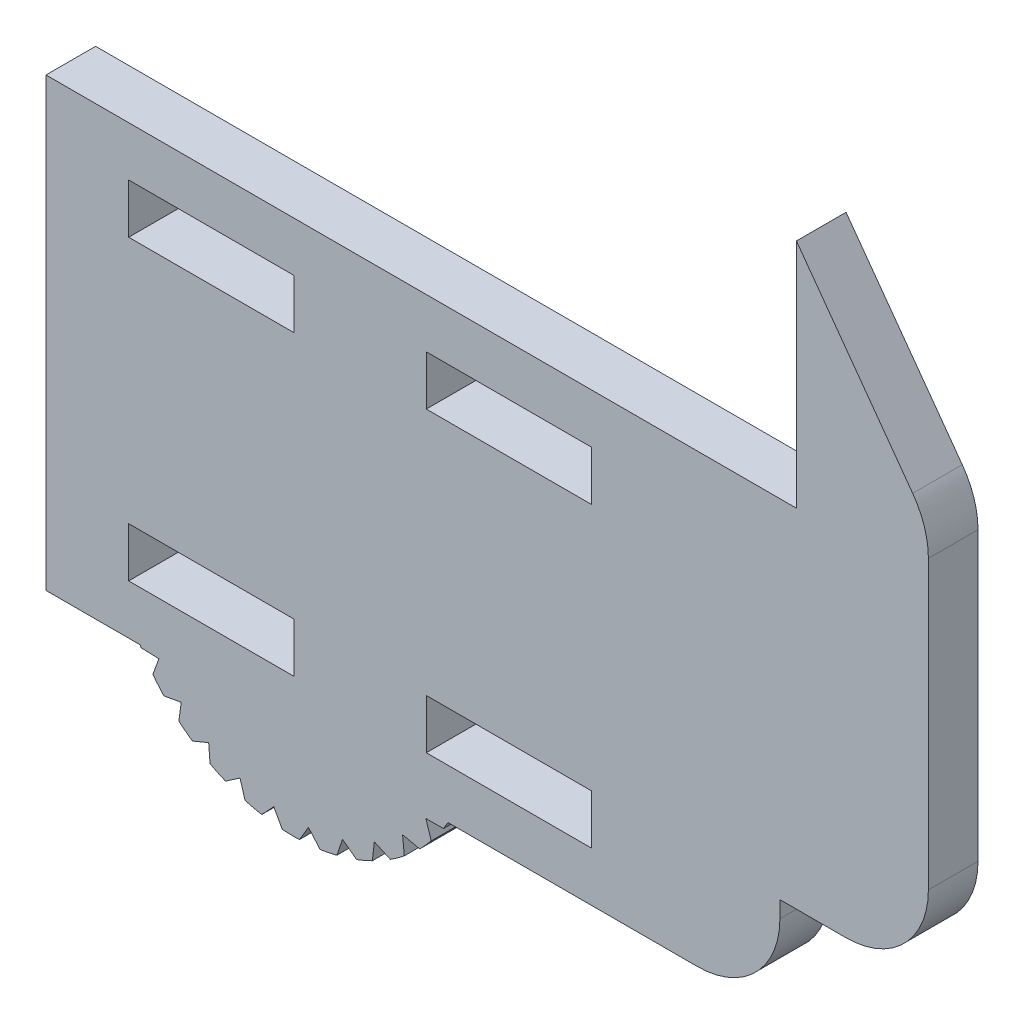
ISO-10303-21;
HEADER;
FILE_DESCRIPTION(('STEP AP214'),'2;1');
FILE_NAME('part.step','',(''),(''),'','','');
FILE_SCHEMA(('AUTOMOTIVE_DESIGN { 1 0 10303 214 1 1 1 1 }'));
ENDSEC;
DATA;
#1=APPLICATION_CONTEXT('core data for automotive mechanical design processes');
#2=APPLICATION_PROTOCOL_DEFINITION('international standard','automotive_design',2000,#1);
#3=PRODUCT_CONTEXT('',#1,'mechanical');
#4=PRODUCT('Part','Part','',(#3));
#5=PRODUCT_RELATED_PRODUCT_CATEGORY('part','',(#4));
#6=PRODUCT_DEFINITION_FORMATION('','',#4);
#7=PRODUCT_DEFINITION_CONTEXT('part definition',#1,'design');
#8=PRODUCT_DEFINITION('design','',#6,#7);
#9=PRODUCT_DEFINITION_SHAPE('','',#8);
#10=(LENGTH_UNIT() NAMED_UNIT(*) SI_UNIT(.MILLI.,.METRE.));
#11=(NAMED_UNIT(*) PLANE_ANGLE_UNIT() SI_UNIT($,.RADIAN.));
#12=(NAMED_UNIT(*) SI_UNIT($,.STERADIAN.) SOLID_ANGLE_UNIT());
#13=UNCERTAINTY_MEASURE_WITH_UNIT(LENGTH_MEASURE(1.E-05),#10,'distance_accuracy_value','');
#14=(GEOMETRIC_REPRESENTATION_CONTEXT(3) GLOBAL_UNCERTAINTY_ASSIGNED_CONTEXT((#13)) GLOBAL_UNIT_ASSIGNED_CONTEXT((#10,
#11,#12)) REPRESENTATION_CONTEXT('',''));
#15=CARTESIAN_POINT('',(0.,0.,0.));
#16=DIRECTION('',(0.,0.,1.));
#17=DIRECTION('',(1.,0.,0.));
#18=AXIS2_PLACEMENT_3D('',#15,#16,#17);
#19=CARTESIAN_POINT('',(-30.3846510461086,-0.656989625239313,0.));
#20=DIRECTION('',(0.,0.,1.));
#21=DIRECTION('',(1.,0.,0.));
#22=AXIS2_PLACEMENT_3D('',#19,#20,#21);
#23=CYLINDRICAL_SURFACE('',#22,10.7346230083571);
#24=DIRECTION('',(0.,0.,1.));
#25=VECTOR('',#24,1.);
#26=CARTESIAN_POINT('',(-38.9217424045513,-7.16469292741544,0.));
#27=LINE('',#26,#25);
#28=CARTESIAN_POINT('',(-38.9217424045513,-7.16469292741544,0.));
#29=VERTEX_POINT('',#28);
#30=CARTESIAN_POINT('',(-38.9217424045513,-7.16469292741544,3.));
#31=VERTEX_POINT('',#30);
#32=EDGE_CURVE('E11',#29,#31,#27,.T.);
#33=ORIENTED_EDGE('',*,*,#32,.F.);
#34=CARTESIAN_POINT('',(-30.3846510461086,-0.656989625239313,0.));
#35=DIRECTION('',(0.,0.,1.));
#36=DIRECTION('',(-1.,0.,0.));
#37=AXIS2_PLACEMENT_3D('',#34,#35,#36);
#38=CIRCLE('',#37,10.7346230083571);
#39=CARTESIAN_POINT('',(-38.2538242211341,-7.95823915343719,0.));
#40=VERTEX_POINT('',#39);
#41=EDGE_CURVE('E426',#29,#40,#38,.T.);
#42=ORIENTED_EDGE('',*,*,#41,.T.);
#43=DIRECTION('',(0.,0.,1.));
#44=VECTOR('',#43,1.);
#45=CARTESIAN_POINT('',(-38.2538242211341,-7.95823915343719,0.));
#46=LINE('',#45,#44);
#47=CARTESIAN_POINT('',(-38.2538242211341,-7.95823915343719,3.));
#48=VERTEX_POINT('',#47);
#49=EDGE_CURVE('E583',#48,#40,#46,.F.);
#50=ORIENTED_EDGE('',*,*,#49,.F.);
#51=CARTESIAN_POINT('',(-30.3846510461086,-0.656989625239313,3.));
#52=DIRECTION('',(0.,0.,1.));
#53=DIRECTION('',(-1.,0.,0.));
#54=AXIS2_PLACEMENT_3D('',#51,#52,#53);
#55=CIRCLE('',#54,10.7346230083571);
#56=EDGE_CURVE('E56',#31,#48,#55,.T.);
#57=ORIENTED_EDGE('',*,*,#56,.F.);
#58=EDGE_LOOP('',(#33,#42,#50,#57));
#59=FACE_BOUND('',#58,.T.);
#60=ADVANCED_FACE('F33',(#59),#23,.T.);
#61=DIRECTION('',(0.,0.,1.));
#62=VECTOR('',#61,1.);
#63=CARTESIAN_POINT('',(-37.3505334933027,-8.82452370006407,0.));
#64=LINE('',#63,#62);
#65=CARTESIAN_POINT('',(-37.3505334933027,-8.82452370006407,0.));
#66=VERTEX_POINT('',#65);
#67=CARTESIAN_POINT('',(-37.3505334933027,-8.82452370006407,3.));
#68=VERTEX_POINT('',#67);
#69=EDGE_CURVE('E412',#66,#68,#64,.T.);
#70=ORIENTED_EDGE('',*,*,#69,.F.);
#71=CARTESIAN_POINT('',(-36.529757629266,-9.45868242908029,0.));
#72=VERTEX_POINT('',#71);
#73=EDGE_CURVE('E431',#66,#72,#38,.T.);
#74=ORIENTED_EDGE('',*,*,#73,.T.);
#75=DIRECTION('',(0.,0.,1.));
#76=VECTOR('',#75,1.);
#77=CARTESIAN_POINT('',(-36.529757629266,-9.45868242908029,0.));
#78=LINE('',#77,#76);
#79=CARTESIAN_POINT('',(-36.529757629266,-9.45868242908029,3.));
#80=VERTEX_POINT('',#79);
#81=EDGE_CURVE('E587',#80,#72,#78,.F.);
#82=ORIENTED_EDGE('',*,*,#81,.F.);
#83=EDGE_CURVE('E443',#68,#80,#55,.T.);
#84=ORIENTED_EDGE('',*,*,#83,.F.);
#85=EDGE_LOOP('',(#70,#74,#82,#84));
#86=FACE_BOUND('',#85,.T.);
#87=ADVANCED_FACE('F947',(#86),#23,.T.);
#88=DIRECTION('',(0.,0.,1.));
#89=VECTOR('',#88,1.);
#90=CARTESIAN_POINT('',(-35.4635452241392,-10.1141015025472,0.));
#91=LINE('',#90,#89);
#92=CARTESIAN_POINT('',(-35.4635452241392,-10.1141015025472,0.));
#93=VERTEX_POINT('',#92);
#94=CARTESIAN_POINT('',(-35.4635452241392,-10.1141015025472,3.));
#95=VERTEX_POINT('',#94);
#96=EDGE_CURVE('E584',#93,#95,#91,.T.);
#97=ORIENTED_EDGE('',*,*,#96,.F.);
#98=CARTESIAN_POINT('',(-34.5271193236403,-10.5601248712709,0.));
#99=VERTEX_POINT('',#98);
#100=EDGE_CURVE('E935',#93,#99,#38,.T.);
#101=ORIENTED_EDGE('',*,*,#100,.T.);
#102=DIRECTION('',(0.,0.,1.));
#103=VECTOR('',#102,1.);
#104=CARTESIAN_POINT('',(-34.5271193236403,-10.5601248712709,0.));
#105=LINE('',#104,#103);
#106=CARTESIAN_POINT('',(-34.5271193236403,-10.5601248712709,3.));
#107=VERTEX_POINT('',#106);
#108=EDGE_CURVE('E594',#107,#99,#105,.F.);
#109=ORIENTED_EDGE('',*,*,#108,.F.);
#110=EDGE_CURVE('E960',#95,#107,#55,.T.);
#111=ORIENTED_EDGE('',*,*,#110,.F.);
#112=EDGE_LOOP('',(#97,#101,#109,#111));
#113=FACE_BOUND('',#112,.T.);
#114=ADVANCED_FACE('F959',(#113),#23,.T.);
#115=DIRECTION('',(0.,0.,1.));
#116=VECTOR('',#115,1.);
#117=CARTESIAN_POINT('',(-33.3463190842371,-10.974966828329,0.));
#118=LINE('',#117,#116);
#119=CARTESIAN_POINT('',(-33.346319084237,-10.974966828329,0.));
#120=VERTEX_POINT('',#119);
#121=CARTESIAN_POINT('',(-33.346319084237,-10.974966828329,3.));
#122=VERTEX_POINT('',#121);
#123=EDGE_CURVE('E592',#120,#122,#118,.T.);
#124=ORIENTED_EDGE('',*,*,#123,.F.);
#125=CARTESIAN_POINT('',(-32.3366934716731,-11.2126355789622,0.));
#126=VERTEX_POINT('',#125);
#127=EDGE_CURVE('E930',#120,#126,#38,.T.);
#128=ORIENTED_EDGE('',*,*,#127,.T.);
#129=DIRECTION('',(0.,0.,1.));
#130=VECTOR('',#129,1.);
#131=CARTESIAN_POINT('',(-32.3366934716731,-11.2126355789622,0.));
#132=LINE('',#131,#130);
#133=CARTESIAN_POINT('',(-32.3366934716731,-11.2126355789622,3.));
#134=VERTEX_POINT('',#133);
#135=EDGE_CURVE('E599',#134,#126,#132,.F.);
#136=ORIENTED_EDGE('',*,*,#135,.F.);
#137=EDGE_CURVE('E962',#122,#134,#55,.T.);
#138=ORIENTED_EDGE('',*,*,#137,.F.);
#139=EDGE_LOOP('',(#124,#128,#136,#138));
#140=FACE_BOUND('',#139,.T.);
#141=ADVANCED_FACE('F1039',(#140),#23,.T.);
#142=DIRECTION('',(0.,0.,1.));
#143=VECTOR('',#142,1.);
#144=CARTESIAN_POINT('',(-31.0948337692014,-11.368094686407,0.));
#145=LINE('',#144,#143);
#146=CARTESIAN_POINT('',(-31.0948337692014,-11.3680946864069,0.));
#147=VERTEX_POINT('',#146);
#148=CARTESIAN_POINT('',(-31.0948337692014,-11.3680946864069,3.));
#149=VERTEX_POINT('',#148);
#150=EDGE_CURVE('E597',#147,#149,#145,.T.);
#151=ORIENTED_EDGE('',*,*,#150,.F.);
#152=CARTESIAN_POINT('',(-30.0577770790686,-11.3866347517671,0.));
#153=VERTEX_POINT('',#152);
#154=EDGE_CURVE('E925',#147,#153,#38,.T.);
#155=ORIENTED_EDGE('',*,*,#154,.T.);
#156=DIRECTION('',(0.,0.,1.));
#157=VECTOR('',#156,1.);
#158=CARTESIAN_POINT('',(-30.0577770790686,-11.3866347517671,0.));
#159=LINE('',#158,#157);
#160=CARTESIAN_POINT('',(-30.0577770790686,-11.3866347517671,3.));
#161=VERTEX_POINT('',#160);
#162=EDGE_CURVE('E604',#161,#153,#159,.F.);
#163=ORIENTED_EDGE('',*,*,#162,.F.);
#164=EDGE_CURVE('E963',#149,#161,#55,.T.);
#165=ORIENTED_EDGE('',*,*,#164,.F.);
#166=EDGE_LOOP('',(#151,#155,#163,#165));
#167=FACE_BOUND('',#166,.T.);
#168=ADVANCED_FACE('F993',(#167),#23,.T.);
#169=DIRECTION('',(0.,0.,1.));
#170=VECTOR('',#169,1.);
#171=CARTESIAN_POINT('',(-28.8111542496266,-11.2756636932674,0.));
#172=LINE('',#171,#170);
#173=CARTESIAN_POINT('',(-28.8111542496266,-11.2756636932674,0.));
#174=VERTEX_POINT('',#173);
#175=CARTESIAN_POINT('',(-28.8111542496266,-11.2756636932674,3.));
#176=VERTEX_POINT('',#175);
#177=EDGE_CURVE('E602',#174,#176,#172,.T.);
#178=ORIENTED_EDGE('',*,*,#177,.F.);
#179=CARTESIAN_POINT('',(-27.7936786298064,-11.0742346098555,0.));
#180=VERTEX_POINT('',#179);
#181=EDGE_CURVE('E920',#174,#180,#38,.T.);
#182=ORIENTED_EDGE('',*,*,#181,.T.);
#183=DIRECTION('',(0.,0.,1.));
#184=VECTOR('',#183,1.);
#185=CARTESIAN_POINT('',(-27.7936786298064,-11.0742346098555,0.));
#186=LINE('',#185,#184);
#187=CARTESIAN_POINT('',(-27.7936786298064,-11.0742346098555,3.));
#188=VERTEX_POINT('',#187);
#189=EDGE_CURVE('E609',#188,#180,#186,.F.);
#190=ORIENTED_EDGE('',*,*,#189,.F.);
#191=EDGE_CURVE('E966',#176,#188,#55,.T.);
#192=ORIENTED_EDGE('',*,*,#191,.F.);
#193=EDGE_LOOP('',(#178,#182,#190,#192));
#194=FACE_BOUND('',#193,.T.);
#195=ADVANCED_FACE('F987',(#194),#23,.T.);
#196=DIRECTION('',(0.,0.,1.));
#197=VECTOR('',#196,1.);
#198=CARTESIAN_POINT('',(-26.5988049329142,-10.7018639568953,0.));
#199=LINE('',#198,#197);
#200=CARTESIAN_POINT('',(-26.5988049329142,-10.7018639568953,0.));
#201=VERTEX_POINT('',#200);
#202=CARTESIAN_POINT('',(-26.5988049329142,-10.7018639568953,3.));
#203=VERTEX_POINT('',#202);
#204=EDGE_CURVE('E607',#201,#203,#199,.T.);
#205=ORIENTED_EDGE('',*,*,#204,.F.);
#206=CARTESIAN_POINT('',(-25.6470348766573,-10.2895969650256,0.));
#207=VERTEX_POINT('',#206);
#208=EDGE_CURVE('E919',#201,#207,#38,.T.);
#209=ORIENTED_EDGE('',*,*,#208,.T.);
#210=DIRECTION('',(0.,0.,1.));
#211=VECTOR('',#210,1.);
#212=CARTESIAN_POINT('',(-25.6470348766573,-10.2895969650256,0.));
#213=LINE('',#212,#211);
#214=CARTESIAN_POINT('',(-25.6470348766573,-10.2895969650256,3.));
#215=VERTEX_POINT('',#214);
#216=EDGE_CURVE('E614',#215,#207,#213,.F.);
#217=ORIENTED_EDGE('',*,*,#216,.F.);
#218=EDGE_CURVE('E969',#203,#215,#55,.T.);
#219=ORIENTED_EDGE('',*,*,#218,.F.);
#220=EDGE_LOOP('',(#205,#209,#217,#219));
#221=FACE_BOUND('',#220,.T.);
#222=ADVANCED_FACE('F985',(#221),#23,.T.);
#223=DIRECTION('',(0.,0.,1.));
#224=VECTOR('',#223,1.);
#225=CARTESIAN_POINT('',(-24.5580766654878,-9.67270712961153,0.));
#226=LINE('',#225,#224);
#227=CARTESIAN_POINT('',(-24.5580766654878,-9.67270712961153,0.));
#228=VERTEX_POINT('',#227);
#229=CARTESIAN_POINT('',(-24.5580766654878,-9.67270712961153,3.));
#230=VERTEX_POINT('',#229);
#231=EDGE_CURVE('E612',#228,#230,#226,.T.);
#232=ORIENTED_EDGE('',*,*,#231,.F.);
#233=CARTESIAN_POINT('',(-23.71515808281,-9.06829123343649,0.));
#234=VERTEX_POINT('',#233);
#235=EDGE_CURVE('E440',#228,#234,#38,.T.);
#236=ORIENTED_EDGE('',*,*,#235,.T.);
#237=DIRECTION('',(0.,0.,1.));
#238=VECTOR('',#237,1.);
#239=CARTESIAN_POINT('',(-23.71515808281,-9.06829123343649,0.));
#240=LINE('',#239,#238);
#241=CARTESIAN_POINT('',(-23.71515808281,-9.06829123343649,3.));
#242=VERTEX_POINT('',#241);
#243=EDGE_CURVE('E619',#242,#234,#240,.F.);
#244=ORIENTED_EDGE('',*,*,#243,.F.);
#245=EDGE_CURVE('E451',#230,#242,#55,.T.);
#246=ORIENTED_EDGE('',*,*,#245,.F.);
#247=EDGE_LOOP('',(#232,#236,#244,#246));
#248=FACE_BOUND('',#247,.T.);
#249=ADVANCED_FACE('F917',(#248),#23,.T.);
#250=DIRECTION('',(0.,0.,1.));
#251=VECTOR('',#250,1.);
#252=CARTESIAN_POINT('',(-22.7814803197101,-8.23484724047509,0.));
#253=LINE('',#252,#251);
#254=CARTESIAN_POINT('',(-22.7814803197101,-8.23484724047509,0.));
#255=VERTEX_POINT('',#254);
#256=CARTESIAN_POINT('',(-22.7814803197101,-8.23484724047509,3.));
#257=VERTEX_POINT('',#256);
#258=EDGE_CURVE('E617',#255,#257,#253,.T.);
#259=ORIENTED_EDGE('',*,*,#258,.F.);
#260=CARTESIAN_POINT('',(-22.0856246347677,-7.46568199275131,0.));
#261=VERTEX_POINT('',#260);
#262=EDGE_CURVE('E434',#255,#261,#38,.T.);
#263=ORIENTED_EDGE('',*,*,#262,.T.);
#264=DIRECTION('',(0.,0.,1.));
#265=VECTOR('',#264,1.);
#266=CARTESIAN_POINT('',(-22.0856246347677,-7.46568199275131,0.));
#267=LINE('',#266,#265);
#268=CARTESIAN_POINT('',(-22.0856246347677,-7.46568199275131,3.));
#269=VERTEX_POINT('',#268);
#270=EDGE_CURVE('E624',#269,#261,#267,.F.);
#271=ORIENTED_EDGE('',*,*,#270,.F.);
#272=EDGE_CURVE('E445',#257,#269,#55,.T.);
#273=ORIENTED_EDGE('',*,*,#272,.F.);
#274=EDGE_LOOP('',(#259,#263,#271,#273));
#275=FACE_BOUND('',#274,.T.);
#276=ADVANCED_FACE('F903',(#275),#23,.T.);
#277=DIRECTION('',(0.,0.,1.));
#278=VECTOR('',#277,1.);
#279=CARTESIAN_POINT('',(-21.3495530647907,-6.45346576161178,0.));
#280=LINE('',#279,#278);
#281=CARTESIAN_POINT('',(-21.3495530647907,-6.45346576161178,0.));
#282=VERTEX_POINT('',#281);
#283=CARTESIAN_POINT('',(-21.3495530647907,-6.45346576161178,3.));
#284=VERTEX_POINT('',#283);
#285=EDGE_CURVE('E622',#282,#284,#280,.T.);
#286=ORIENTED_EDGE('',*,*,#285,.F.);
#287=CARTESIAN_POINT('',(-21.0742068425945,-6.,0.));
#288=VERTEX_POINT('',#287);
#289=EDGE_CURVE('E428',#282,#288,#38,.T.);
#290=ORIENTED_EDGE('',*,*,#289,.T.);
#291=DIRECTION('',(0.,0.,1.));
#292=VECTOR('',#291,1.);
#293=CARTESIAN_POINT('',(-21.0742068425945,-6.,0.));
#294=LINE('',#293,#292);
#295=CARTESIAN_POINT('',(-21.0742068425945,-6.,3.));
#296=VERTEX_POINT('',#295);
#297=EDGE_CURVE('E425',#288,#296,#294,.T.);
#298=ORIENTED_EDGE('',*,*,#297,.T.);
#299=EDGE_CURVE('E441',#284,#296,#55,.T.);
#300=ORIENTED_EDGE('',*,*,#299,.F.);
#301=EDGE_LOOP('',(#286,#290,#298,#300));
#302=FACE_BOUND('',#301,.T.);
#303=ADVANCED_FACE('F889',(#302),#23,.T.);
#304=CARTESIAN_POINT('',(-0.999999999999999,-5.99999999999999,3.));
#305=DIRECTION('',(0.,1.,0.));
#306=DIRECTION('',(-1.,0.,0.));
#307=AXIS2_PLACEMENT_3D('',#304,#305,#306);
#308=PLANE('',#307);
#309=DIRECTION('',(1.,0.,0.));
#310=VECTOR('',#309,1.);
#311=CARTESIAN_POINT('',(-0.999999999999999,-5.99999999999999,0.));
#312=LINE('',#311,#310);
#313=CARTESIAN_POINT('',(-45.3846510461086,-6.,0.));
#314=VERTEX_POINT('',#313);
#315=CARTESIAN_POINT('',(-39.6950952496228,-6.,0.));
#316=VERTEX_POINT('',#315);
#317=EDGE_CURVE('E682',#314,#316,#312,.T.);
#318=ORIENTED_EDGE('',*,*,#317,.T.);
#319=DIRECTION('',(0.,0.,1.));
#320=VECTOR('',#319,1.);
#321=CARTESIAN_POINT('',(-39.6950952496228,-6.,0.));
#322=LINE('',#321,#320);
#323=CARTESIAN_POINT('',(-39.6950952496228,-6.,3.));
#324=VERTEX_POINT('',#323);
#325=EDGE_CURVE('E424',#316,#324,#322,.T.);
#326=ORIENTED_EDGE('',*,*,#325,.T.);
#327=DIRECTION('',(1.,0.,0.));
#328=VECTOR('',#327,1.);
#329=CARTESIAN_POINT('',(-0.999999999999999,-5.99999999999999,3.));
#330=LINE('',#329,#328);
#331=CARTESIAN_POINT('',(-45.3846510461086,-6.,3.));
#332=VERTEX_POINT('',#331);
#333=EDGE_CURVE('E701',#332,#324,#330,.T.);
#334=ORIENTED_EDGE('',*,*,#333,.F.);
#335=DIRECTION('',(0.,0.,-1.));
#336=VECTOR('',#335,1.);
#337=CARTESIAN_POINT('',(-45.3846510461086,-6.,3.));
#338=LINE('',#337,#336);
#339=EDGE_CURVE('E662',#332,#314,#338,.T.);
#340=ORIENTED_EDGE('',*,*,#339,.T.);
#341=EDGE_LOOP('',(#318,#326,#334,#340));
#342=FACE_BOUND('',#341,.T.);
#343=ADVANCED_FACE('F838',(#342),#308,.F.);
#344=CARTESIAN_POINT('',(0.,21.,3.));
#345=DIRECTION('',(1.,0.,0.));
#346=DIRECTION('',(0.,0.,-1.));
#347=AXIS2_PLACEMENT_3D('',#344,#345,#346);
#348=PLANE('',#347);
#349=DIRECTION('',(0.,-1.,0.));
#350=VECTOR('',#349,1.);
#351=CARTESIAN_POINT('',(0.,21.,0.));
#352=LINE('',#351,#350);
#353=CARTESIAN_POINT('',(0.,35.,0.));
#354=VERTEX_POINT('',#353);
#355=CARTESIAN_POINT('',(0.,21.,0.));
#356=VERTEX_POINT('',#355);
#357=EDGE_CURVE('E689',#354,#356,#352,.T.);
#358=ORIENTED_EDGE('',*,*,#357,.T.);
#359=DIRECTION('',(0.,0.,-1.));
#360=VECTOR('',#359,1.);
#361=CARTESIAN_POINT('',(0.,21.,3.));
#362=LINE('',#361,#360);
#363=CARTESIAN_POINT('',(0.,21.,3.));
#364=VERTEX_POINT('',#363);
#365=EDGE_CURVE('E656',#364,#356,#362,.T.);
#366=ORIENTED_EDGE('',*,*,#365,.F.);
#367=DIRECTION('',(0.,-1.,0.));
#368=VECTOR('',#367,1.);
#369=CARTESIAN_POINT('',(0.,21.,3.));
#370=LINE('',#369,#368);
#371=CARTESIAN_POINT('',(0.,35.,3.));
#372=VERTEX_POINT('',#371);
#373=EDGE_CURVE('E674',#372,#364,#370,.T.);
#374=ORIENTED_EDGE('',*,*,#373,.F.);
#375=DIRECTION('',(0.,0.,-1.));
#376=VECTOR('',#375,1.);
#377=CARTESIAN_POINT('',(0.,35.,3.));
#378=LINE('',#377,#376);
#379=EDGE_CURVE('E668',#372,#354,#378,.T.);
#380=ORIENTED_EDGE('',*,*,#379,.T.);
#381=EDGE_LOOP('',(#358,#366,#374,#380));
#382=FACE_BOUND('',#381,.T.);
#383=ADVANCED_FACE('F853',(#382),#348,.F.);
#384=CARTESIAN_POINT('',(-45.3846510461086,21.,3.));
#385=DIRECTION('',(0.,-1.,0.));
#386=DIRECTION('',(0.,0.,-1.));
#387=AXIS2_PLACEMENT_3D('',#384,#385,#386);
#388=PLANE('',#387);
#389=DIRECTION('',(-1.,0.,0.));
#390=VECTOR('',#389,1.);
#391=CARTESIAN_POINT('',(-45.3846510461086,21.,0.));
#392=LINE('',#391,#390);
#393=CARTESIAN_POINT('',(-45.3846510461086,21.,0.));
#394=VERTEX_POINT('',#393);
#395=EDGE_CURVE('E687',#356,#394,#392,.T.);
#396=ORIENTED_EDGE('',*,*,#395,.T.);
#397=DIRECTION('',(0.,0.,-1.));
#398=VECTOR('',#397,1.);
#399=CARTESIAN_POINT('',(-45.3846510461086,21.,3.));
#400=LINE('',#399,#398);
#401=CARTESIAN_POINT('',(-45.3846510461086,21.,3.));
#402=VERTEX_POINT('',#401);
#403=EDGE_CURVE('E659',#402,#394,#400,.T.);
#404=ORIENTED_EDGE('',*,*,#403,.F.);
#405=DIRECTION('',(-1.,0.,0.));
#406=VECTOR('',#405,1.);
#407=CARTESIAN_POINT('',(-45.3846510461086,21.,3.));
#408=LINE('',#407,#406);
#409=EDGE_CURVE('E706',#364,#402,#408,.T.);
#410=ORIENTED_EDGE('',*,*,#409,.F.);
#411=ORIENTED_EDGE('',*,*,#365,.T.);
#412=EDGE_LOOP('',(#396,#404,#410,#411));
#413=FACE_BOUND('',#412,.T.);
#414=ADVANCED_FACE('F850',(#413),#388,.F.);
#415=CARTESIAN_POINT('',(-45.3846510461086,-6.,3.));
#416=DIRECTION('',(1.,0.,0.));
#417=DIRECTION('',(0.,0.,-1.));
#418=AXIS2_PLACEMENT_3D('',#415,#416,#417);
#419=PLANE('',#418);
#420=DIRECTION('',(0.,-1.,0.));
#421=VECTOR('',#420,1.);
#422=CARTESIAN_POINT('',(-45.3846510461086,-6.,0.));
#423=LINE('',#422,#421);
#424=EDGE_CURVE('E685',#394,#314,#423,.T.);
#425=ORIENTED_EDGE('',*,*,#424,.T.);
#426=ORIENTED_EDGE('',*,*,#339,.F.);
#427=DIRECTION('',(0.,-1.,0.));
#428=VECTOR('',#427,1.);
#429=CARTESIAN_POINT('',(-45.3846510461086,-6.,3.));
#430=LINE('',#429,#428);
#431=EDGE_CURVE('E704',#402,#332,#430,.T.);
#432=ORIENTED_EDGE('',*,*,#431,.F.);
#433=ORIENTED_EDGE('',*,*,#403,.T.);
#434=EDGE_LOOP('',(#425,#426,#432,#433));
#435=FACE_BOUND('',#434,.T.);
#436=ADVANCED_FACE('F844',(#435),#419,.F.);
#437=CARTESIAN_POINT('',(-6.,-6.,0.));
#438=VERTEX_POINT('',#437);
#439=EDGE_CURVE('E684',#288,#438,#312,.T.);
#440=ORIENTED_EDGE('',*,*,#439,.T.);
#441=DIRECTION('',(0.,0.,-1.));
#442=VECTOR('',#441,1.);
#443=CARTESIAN_POINT('',(-6.,-6.,3.));
#444=LINE('',#443,#442);
#445=CARTESIAN_POINT('',(-6.,-6.,3.));
#446=VERTEX_POINT('',#445);
#447=EDGE_CURVE('E629',#438,#446,#444,.F.);
#448=ORIENTED_EDGE('',*,*,#447,.T.);
#449=EDGE_CURVE('E703',#296,#446,#330,.T.);
#450=ORIENTED_EDGE('',*,*,#449,.F.);
#451=ORIENTED_EDGE('',*,*,#297,.F.);
#452=EDGE_LOOP('',(#440,#448,#450,#451));
#453=FACE_BOUND('',#452,.T.);
#454=ADVANCED_FACE('F887',(#453),#308,.F.);
#455=CARTESIAN_POINT('',(-1.,0.,3.));
#456=DIRECTION('',(-1.,0.,0.));
#457=DIRECTION('',(0.,-1.,0.));
#458=AXIS2_PLACEMENT_3D('',#455,#456,#457);
#459=PLANE('',#458);
#460=DIRECTION('',(0.,1.,0.));
#461=VECTOR('',#460,1.);
#462=CARTESIAN_POINT('',(-1.,0.,3.));
#463=LINE('',#462,#461);
#464=CARTESIAN_POINT('',(-1.,-0.999999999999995,3.));
#465=VERTEX_POINT('',#464);
#466=CARTESIAN_POINT('',(-1.,0.,3.));
#467=VERTEX_POINT('',#466);
#468=EDGE_CURVE('E699',#465,#467,#463,.T.);
#469=ORIENTED_EDGE('',*,*,#468,.F.);
#470=DIRECTION('',(0.,0.,-1.));
#471=VECTOR('',#470,1.);
#472=CARTESIAN_POINT('',(-1.,-0.999999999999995,3.));
#473=LINE('',#472,#471);
#474=CARTESIAN_POINT('',(-1.,-0.999999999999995,0.));
#475=VERTEX_POINT('',#474);
#476=EDGE_CURVE('E633',#465,#475,#473,.T.);
#477=ORIENTED_EDGE('',*,*,#476,.T.);
#478=DIRECTION('',(0.,1.,0.));
#479=VECTOR('',#478,1.);
#480=CARTESIAN_POINT('',(-1.,0.,0.));
#481=LINE('',#480,#479);
#482=CARTESIAN_POINT('',(-1.,0.,0.));
#483=VERTEX_POINT('',#482);
#484=EDGE_CURVE('E680',#475,#483,#481,.T.);
#485=ORIENTED_EDGE('',*,*,#484,.T.);
#486=DIRECTION('',(0.,0.,-1.));
#487=VECTOR('',#486,1.);
#488=CARTESIAN_POINT('',(-1.,0.,3.));
#489=LINE('',#488,#487);
#490=EDGE_CURVE('E665',#467,#483,#489,.T.);
#491=ORIENTED_EDGE('',*,*,#490,.F.);
#492=EDGE_LOOP('',(#469,#477,#485,#491));
#493=FACE_BOUND('',#492,.T.);
#494=ADVANCED_FACE('F880',(#493),#459,.F.);
#495=CARTESIAN_POINT('',(-1.,0.,3.));
#496=DIRECTION('',(0.,1.,0.));
#497=DIRECTION('',(-1.,0.,0.));
#498=AXIS2_PLACEMENT_3D('',#495,#496,#497);
#499=PLANE('',#498);
#500=DIRECTION('',(1.,0.,0.));
#501=VECTOR('',#500,1.);
#502=CARTESIAN_POINT('',(-1.,0.,0.));
#503=LINE('',#502,#501);
#504=CARTESIAN_POINT('',(2.9812626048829,0.,0.));
#505=VERTEX_POINT('',#504);
#506=EDGE_CURVE('E677',#483,#505,#503,.T.);
#507=ORIENTED_EDGE('',*,*,#506,.T.);
#508=DIRECTION('',(0.,0.,-1.));
#509=VECTOR('',#508,1.);
#510=CARTESIAN_POINT('',(2.9812626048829,0.,3.));
#511=LINE('',#510,#509);
#512=CARTESIAN_POINT('',(2.9812626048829,0.,3.));
#513=VERTEX_POINT('',#512);
#514=EDGE_CURVE('E638',#505,#513,#511,.F.);
#515=ORIENTED_EDGE('',*,*,#514,.T.);
#516=DIRECTION('',(1.,0.,0.));
#517=VECTOR('',#516,1.);
#518=CARTESIAN_POINT('',(-1.,0.,3.));
#519=LINE('',#518,#517);
#520=EDGE_CURVE('E696',#467,#513,#519,.T.);
#521=ORIENTED_EDGE('',*,*,#520,.F.);
#522=ORIENTED_EDGE('',*,*,#490,.T.);
#523=EDGE_LOOP('',(#507,#515,#521,#522));
#524=FACE_BOUND('',#523,.T.);
#525=ADVANCED_FACE('F875',(#524),#499,.F.);
#526=CARTESIAN_POINT('',(7.9812626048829,23.9833696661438,3.));
#527=DIRECTION('',(-1.,0.,0.));
#528=DIRECTION('',(0.,0.,1.));
#529=AXIS2_PLACEMENT_3D('',#526,#527,#528);
#530=PLANE('',#529);
#531=DIRECTION('',(0.,1.,0.));
#532=VECTOR('',#531,1.);
#533=CARTESIAN_POINT('',(7.9812626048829,23.9833696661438,3.));
#534=LINE('',#533,#532);
#535=CARTESIAN_POINT('',(7.9812626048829,5.,3.));
#536=VERTEX_POINT('',#535);
#537=CARTESIAN_POINT('',(7.9812626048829,22.3625159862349,3.));
#538=VERTEX_POINT('',#537);
#539=EDGE_CURVE('E694',#536,#538,#534,.T.);
#540=ORIENTED_EDGE('',*,*,#539,.F.);
#541=DIRECTION('',(0.,0.,-1.));
#542=VECTOR('',#541,1.);
#543=CARTESIAN_POINT('',(7.9812626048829,5.,3.));
#544=LINE('',#543,#542);
#545=CARTESIAN_POINT('',(7.9812626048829,5.,0.));
#546=VERTEX_POINT('',#545);
#547=EDGE_CURVE('E642',#536,#546,#544,.T.);
#548=ORIENTED_EDGE('',*,*,#547,.T.);
#549=DIRECTION('',(0.,1.,0.));
#550=VECTOR('',#549,1.);
#551=CARTESIAN_POINT('',(7.9812626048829,23.9833696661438,0.));
#552=LINE('',#551,#550);
#553=CARTESIAN_POINT('',(7.9812626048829,22.3625159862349,0.));
#554=VERTEX_POINT('',#553);
#555=EDGE_CURVE('E675',#546,#554,#552,.T.);
#556=ORIENTED_EDGE('',*,*,#555,.T.);
#557=DIRECTION('',(0.,0.,-1.));
#558=VECTOR('',#557,1.);
#559=CARTESIAN_POINT('',(7.9812626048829,22.3625159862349,3.));
#560=LINE('',#559,#558);
#561=EDGE_CURVE('E647',#554,#538,#560,.F.);
#562=ORIENTED_EDGE('',*,*,#561,.T.);
#563=EDGE_LOOP('',(#540,#548,#556,#562));
#564=FACE_BOUND('',#563,.T.);
#565=ADVANCED_FACE('F866',(#564),#530,.F.);
#566=CARTESIAN_POINT('',(0.,35.,3.));
#567=DIRECTION('',(-0.809812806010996,-0.586688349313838,0.));
#568=DIRECTION('',(0.586688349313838,-0.809812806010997,0.));
#569=AXIS2_PLACEMENT_3D('',#566,#567,#568);
#570=PLANE('',#569);
#571=DIRECTION('',(-0.586688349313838,0.809812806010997,0.));
#572=VECTOR('',#571,1.);
#573=CARTESIAN_POINT('',(0.,35.,3.));
#574=LINE('',#573,#572);
#575=CARTESIAN_POINT('',(7.03032663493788,25.295957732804,3.));
#576=VERTEX_POINT('',#575);
#577=EDGE_CURVE('E671',#576,#372,#574,.T.);
#578=ORIENTED_EDGE('',*,*,#577,.F.);
#579=DIRECTION('',(0.,0.,-1.));
#580=VECTOR('',#579,1.);
#581=CARTESIAN_POINT('',(7.03032663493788,25.295957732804,3.));
#582=LINE('',#581,#580);
#583=CARTESIAN_POINT('',(7.03032663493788,25.295957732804,0.));
#584=VERTEX_POINT('',#583);
#585=EDGE_CURVE('E653',#576,#584,#582,.T.);
#586=ORIENTED_EDGE('',*,*,#585,.T.);
#587=DIRECTION('',(-0.586688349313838,0.809812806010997,0.));
#588=VECTOR('',#587,1.);
#589=CARTESIAN_POINT('',(0.,35.,0.));
#590=LINE('',#589,#588);
#591=EDGE_CURVE('E672',#584,#354,#590,.T.);
#592=ORIENTED_EDGE('',*,*,#591,.T.);
#593=ORIENTED_EDGE('',*,*,#379,.F.);
#594=EDGE_LOOP('',(#578,#586,#592,#593));
#595=FACE_BOUND('',#594,.T.);
#596=ADVANCED_FACE('F857',(#595),#570,.F.);
#597=CARTESIAN_POINT('',(0.,0.,3.));
#598=DIRECTION('',(0.,0.,-1.));
#599=DIRECTION('',(-1.,0.,0.));
#600=AXIS2_PLACEMENT_3D('',#597,#598,#599);
#601=PLANE('',#600);
#602=DIRECTION('',(1.,0.,0.));
#603=VECTOR('',#602,1.);
#604=CARTESIAN_POINT('',(-30.3846510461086,0.,3.));
#605=LINE('',#604,#603);
#606=CARTESIAN_POINT('',(-40.3846510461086,0.,3.));
#607=VERTEX_POINT('',#606);
#608=CARTESIAN_POINT('',(-30.3846510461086,0.,3.));
#609=VERTEX_POINT('',#608);
#610=EDGE_CURVE('E810',#607,#609,#605,.T.);
#611=ORIENTED_EDGE('',*,*,#610,.T.);
#612=DIRECTION('',(0.,-1.,0.));
#613=VECTOR('',#612,1.);
#614=CARTESIAN_POINT('',(-30.3846510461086,0.,3.));
#615=LINE('',#614,#613);
#616=CARTESIAN_POINT('',(-30.3846510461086,-3.,3.));
#617=VERTEX_POINT('',#616);
#618=EDGE_CURVE('E818',#609,#617,#615,.T.);
#619=ORIENTED_EDGE('',*,*,#618,.T.);
#620=DIRECTION('',(-1.,0.,0.));
#621=VECTOR('',#620,1.);
#622=CARTESIAN_POINT('',(-30.3846510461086,-3.,3.));
#623=LINE('',#622,#621);
#624=CARTESIAN_POINT('',(-40.3846510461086,-3.,3.));
#625=VERTEX_POINT('',#624);
#626=EDGE_CURVE('E832',#617,#625,#623,.T.);
#627=ORIENTED_EDGE('',*,*,#626,.T.);
#628=DIRECTION('',(0.,1.,0.));
#629=VECTOR('',#628,1.);
#630=CARTESIAN_POINT('',(-40.3846510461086,0.,3.));
#631=LINE('',#630,#629);
#632=EDGE_CURVE('E829',#625,#607,#631,.T.);
#633=ORIENTED_EDGE('',*,*,#632,.T.);
#634=EDGE_LOOP('',(#611,#619,#627,#633));
#635=FACE_BOUND('',#634,.T.);
#636=DIRECTION('',(1.,0.,0.));
#637=VECTOR('',#636,1.);
#638=CARTESIAN_POINT('',(-12.3846510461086,0.,3.));
#639=LINE('',#638,#637);
#640=CARTESIAN_POINT('',(-22.3846510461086,0.,3.));
#641=VERTEX_POINT('',#640);
#642=CARTESIAN_POINT('',(-12.3846510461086,0.,3.));
#643=VERTEX_POINT('',#642);
#644=EDGE_CURVE('E778',#641,#643,#639,.T.);
#645=ORIENTED_EDGE('',*,*,#644,.T.);
#646=DIRECTION('',(0.,-1.,0.));
#647=VECTOR('',#646,1.);
#648=CARTESIAN_POINT('',(-12.3846510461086,0.,3.));
#649=LINE('',#648,#647);
#650=CARTESIAN_POINT('',(-12.3846510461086,-3.,3.));
#651=VERTEX_POINT('',#650);
#652=EDGE_CURVE('E786',#643,#651,#649,.T.);
#653=ORIENTED_EDGE('',*,*,#652,.T.);
#654=DIRECTION('',(-1.,0.,0.));
#655=VECTOR('',#654,1.);
#656=CARTESIAN_POINT('',(-12.3846510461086,-3.,3.));
#657=LINE('',#656,#655);
#658=CARTESIAN_POINT('',(-22.3846510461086,-3.,3.));
#659=VERTEX_POINT('',#658);
#660=EDGE_CURVE('E801',#651,#659,#657,.T.);
#661=ORIENTED_EDGE('',*,*,#660,.T.);
#662=DIRECTION('',(0.,1.,0.));
#663=VECTOR('',#662,1.);
#664=CARTESIAN_POINT('',(-22.3846510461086,0.,3.));
#665=LINE('',#664,#663);
#666=EDGE_CURVE('E798',#659,#641,#665,.T.);
#667=ORIENTED_EDGE('',*,*,#666,.T.);
#668=EDGE_LOOP('',(#645,#653,#661,#667));
#669=FACE_BOUND('',#668,.T.);
#670=DIRECTION('',(1.,0.,0.));
#671=VECTOR('',#670,1.);
#672=CARTESIAN_POINT('',(-30.3846510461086,18.,3.));
#673=LINE('',#672,#671);
#674=CARTESIAN_POINT('',(-40.3846510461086,18.,3.));
#675=VERTEX_POINT('',#674);
#676=CARTESIAN_POINT('',(-30.3846510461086,18.,3.));
#677=VERTEX_POINT('',#676);
#678=EDGE_CURVE('E746',#675,#677,#673,.T.);
#679=ORIENTED_EDGE('',*,*,#678,.T.);
#680=DIRECTION('',(0.,-1.,0.));
#681=VECTOR('',#680,1.);
#682=CARTESIAN_POINT('',(-30.3846510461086,18.,3.));
#683=LINE('',#682,#681);
#684=CARTESIAN_POINT('',(-30.3846510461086,15.,3.));
#685=VERTEX_POINT('',#684);
#686=EDGE_CURVE('E754',#677,#685,#683,.T.);
#687=ORIENTED_EDGE('',*,*,#686,.T.);
#688=DIRECTION('',(-1.,0.,0.));
#689=VECTOR('',#688,1.);
#690=CARTESIAN_POINT('',(-30.3846510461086,15.,3.));
#691=LINE('',#690,#689);
#692=CARTESIAN_POINT('',(-40.3846510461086,15.,3.));
#693=VERTEX_POINT('',#692);
#694=EDGE_CURVE('E769',#685,#693,#691,.T.);
#695=ORIENTED_EDGE('',*,*,#694,.T.);
#696=DIRECTION('',(0.,1.,0.));
#697=VECTOR('',#696,1.);
#698=CARTESIAN_POINT('',(-40.3846510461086,18.,3.));
#699=LINE('',#698,#697);
#700=EDGE_CURVE('E766',#693,#675,#699,.T.);
#701=ORIENTED_EDGE('',*,*,#700,.T.);
#702=EDGE_LOOP('',(#679,#687,#695,#701));
#703=FACE_BOUND('',#702,.T.);
#704=DIRECTION('',(1.,0.,0.));
#705=VECTOR('',#704,1.);
#706=CARTESIAN_POINT('',(-12.3846510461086,18.,3.));
#707=LINE('',#706,#705);
#708=CARTESIAN_POINT('',(-22.3846510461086,18.,3.));
#709=VERTEX_POINT('',#708);
#710=CARTESIAN_POINT('',(-12.3846510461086,18.,3.));
#711=VERTEX_POINT('',#710);
#712=EDGE_CURVE('E714',#709,#711,#707,.T.);
#713=ORIENTED_EDGE('',*,*,#712,.T.);
#714=DIRECTION('',(0.,-1.,0.));
#715=VECTOR('',#714,1.);
#716=CARTESIAN_POINT('',(-12.3846510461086,15.,3.));
#717=LINE('',#716,#715);
#718=CARTESIAN_POINT('',(-12.3846510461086,15.,3.));
#719=VERTEX_POINT('',#718);
#720=EDGE_CURVE('E722',#711,#719,#717,.T.);
#721=ORIENTED_EDGE('',*,*,#720,.T.);
#722=DIRECTION('',(-1.,0.,0.));
#723=VECTOR('',#722,1.);
#724=CARTESIAN_POINT('',(-12.3846510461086,15.,3.));
#725=LINE('',#724,#723);
#726=CARTESIAN_POINT('',(-22.3846510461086,15.,3.));
#727=VERTEX_POINT('',#726);
#728=EDGE_CURVE('E737',#719,#727,#725,.T.);
#729=ORIENTED_EDGE('',*,*,#728,.T.);
#730=DIRECTION('',(0.,1.,0.));
#731=VECTOR('',#730,1.);
#732=CARTESIAN_POINT('',(-22.3846510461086,15.,3.));
#733=LINE('',#732,#731);
#734=EDGE_CURVE('E734',#727,#709,#733,.T.);
#735=ORIENTED_EDGE('',*,*,#734,.T.);
#736=EDGE_LOOP('',(#713,#721,#729,#735));
#737=FACE_BOUND('',#736,.T.);
#738=DIRECTION('',(0.999360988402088,-0.0357437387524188,0.));
#739=VECTOR('',#738,1.);
#740=CARTESIAN_POINT('',(-0.269475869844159,-7.53428938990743,3.));
#741=LINE('',#740,#739);
#742=CARTESIAN_POINT('',(-39.6211632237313,-6.12681356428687,3.));
#743=VERTEX_POINT('',#742);
#744=CARTESIAN_POINT('',(-38.5578276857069,-6.16484545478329,3.));
#745=VERTEX_POINT('',#744);
#746=EDGE_CURVE('E48',#743,#745,#741,.T.);
#747=ORIENTED_EDGE('',*,*,#746,.T.);
#748=DIRECTION('',(-0.342020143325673,-0.939692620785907,0.));
#749=VECTOR('',#748,1.);
#750=CARTESIAN_POINT('',(-32.0660755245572,11.671097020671,3.));
#751=LINE('',#750,#749);
#752=EDGE_CURVE('E566',#745,#31,#751,.T.);
#753=ORIENTED_EDGE('',*,*,#752,.T.);
#754=ORIENTED_EDGE('',*,*,#56,.T.);
#755=DIRECTION('',(0.984276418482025,0.17663502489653,0.));
#756=VECTOR('',#755,1.);
#757=CARTESIAN_POINT('',(0.190084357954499,-1.05922113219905,3.));
#758=LINE('',#757,#756);
#759=CARTESIAN_POINT('',(-37.2065388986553,-7.77029675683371,3.));
#760=VERTEX_POINT('',#759);
#761=EDGE_CURVE('E557',#48,#760,#758,.T.);
#762=ORIENTED_EDGE('',*,*,#761,.T.);
#763=DIRECTION('',(-0.135331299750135,-0.990800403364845,0.));
#764=VECTOR('',#763,1.);
#765=CARTESIAN_POINT('',(-35.4832270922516,4.84657780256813,3.));
#766=LINE('',#765,#764);
#767=EDGE_CURVE('E554',#760,#68,#766,.T.);
#768=ORIENTED_EDGE('',*,*,#767,.T.);
#769=ORIENTED_EDGE('',*,*,#83,.T.);
#770=DIRECTION('',(0.924572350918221,0.381006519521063,0.));
#771=VECTOR('',#770,1.);
#772=CARTESIAN_POINT('',(-1.97088559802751,4.7826644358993,3.));
#773=LINE('',#772,#771);
#774=CARTESIAN_POINT('',(-35.5459983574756,-9.05328560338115,3.));
#775=VERTEX_POINT('',#774);
#776=EDGE_CURVE('E544',#80,#775,#773,.T.);
#777=ORIENTED_EDGE('',*,*,#776,.T.);
#778=DIRECTION('',(0.0774924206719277,-0.996992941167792,0.));
#779=VECTOR('',#778,1.);
#780=CARTESIAN_POINT('',(-36.03199334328,-2.80062803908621,3.));
#781=LINE('',#780,#779);
#782=EDGE_CURVE('E541',#775,#95,#781,.T.);
#783=ORIENTED_EDGE('',*,*,#782,.T.);
#784=ORIENTED_EDGE('',*,*,#110,.T.);
#785=DIRECTION('',(0.822955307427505,0.568106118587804,0.));
#786=VECTOR('',#785,1.);
#787=CARTESIAN_POINT('',(-6.20630763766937,8.99042211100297,3.));
#788=LINE('',#787,#786);
#789=CARTESIAN_POINT('',(-33.6514821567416,-9.95565118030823,3.));
#790=VERTEX_POINT('',#789);
#791=EDGE_CURVE('E531',#107,#790,#788,.T.);
#792=ORIENTED_EDGE('',*,*,#791,.T.);
#793=DIRECTION('',(0.286803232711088,-0.95798951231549,0.));
#794=VECTOR('',#793,1.);
#795=CARTESIAN_POINT('',(-33.6188025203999,-10.0648087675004,3.));
#796=LINE('',#795,#794);
#797=EDGE_CURVE('E528',#790,#122,#796,.T.);
#798=ORIENTED_EDGE('',*,*,#797,.T.);
#799=ORIENTED_EDGE('',*,*,#137,.T.);
#800=DIRECTION('',(0.684031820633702,0.72945217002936,0.));
#801=VECTOR('',#800,1.);
#802=CARTESIAN_POINT('',(-11.6116178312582,10.8886043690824,3.));
#803=LINE('',#802,#801);
#804=CARTESIAN_POINT('',(-31.6088730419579,-10.4364871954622,3.));
#805=VERTEX_POINT('',#804);
#806=EDGE_CURVE('E518',#134,#805,#803,.T.);
#807=ORIENTED_EDGE('',*,*,#806,.T.);
#808=DIRECTION('',(0.483112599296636,-0.875558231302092,0.));
#809=VECTOR('',#808,1.);
#810=CARTESIAN_POINT('',(-28.6459953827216,-15.8061917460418,3.));
#811=LINE('',#810,#809);
#812=EDGE_CURVE('E515',#805,#149,#811,.T.);
#813=ORIENTED_EDGE('',*,*,#812,.T.);
#814=ORIENTED_EDGE('',*,*,#164,.T.);
#815=DIRECTION('',(0.51409960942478,0.857730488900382,0.));
#816=VECTOR('',#815,1.);
#817=CARTESIAN_POINT('',(-17.0925163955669,10.2447751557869,3.));
#818=LINE('',#817,#816);
#819=CARTESIAN_POINT('',(-29.510767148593,-10.4739962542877,3.));
#820=VERTEX_POINT('',#819);
#821=EDGE_CURVE('E505',#161,#820,#818,.T.);
#822=ORIENTED_EDGE('',*,*,#821,.T.);
#823=DIRECTION('',(0.657521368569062,-0.753435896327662,0.));
#824=VECTOR('',#823,1.);
#825=CARTESIAN_POINT('',(-21.9410686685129,-19.1479083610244,3.));
#826=LINE('',#825,#824);
#827=EDGE_CURVE('E502',#820,#176,#826,.T.);
#828=ORIENTED_EDGE('',*,*,#827,.T.);
#829=ORIENTED_EDGE('',*,*,#191,.T.);
#830=DIRECTION('',(0.320862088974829,0.947125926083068,0.));
#831=VECTOR('',#830,1.);
#832=CARTESIAN_POINT('',(-21.566825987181,7.30629016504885,3.));
#833=LINE('',#832,#831);
#834=CARTESIAN_POINT('',(-27.4522764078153,-10.0664779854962,3.));
#835=VERTEX_POINT('',#834);
#836=EDGE_CURVE('E492',#188,#835,#833,.T.);
#837=ORIENTED_EDGE('',*,*,#836,.T.);
#838=DIRECTION('',(0.802123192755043,-0.597158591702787,0.));
#839=VECTOR('',#838,1.);
#840=CARTESIAN_POINT('',(-14.6112275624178,-19.6262846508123,3.));
#841=LINE('',#840,#839);
#842=EDGE_CURVE('E489',#835,#203,#841,.T.);
#843=ORIENTED_EDGE('',*,*,#842,.T.);
#844=ORIENTED_EDGE('',*,*,#218,.T.);
#845=DIRECTION('',(0.113079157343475,0.99358598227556,0.));
#846=VECTOR('',#845,1.);
#847=CARTESIAN_POINT('',(-24.1630129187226,2.74997150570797,3.));
#848=LINE('',#847,#846);
#849=CARTESIAN_POINT('',(-25.5267169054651,-9.23240612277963,3.));
#850=VERTEX_POINT('',#849);
#851=EDGE_CURVE('E479',#215,#850,#848,.T.);
#852=ORIENTED_EDGE('',*,*,#851,.T.);
#853=DIRECTION('',(0.910362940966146,-0.41381072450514,0.));
#854=VECTOR('',#853,1.);
#855=CARTESIAN_POINT('',(-7.84919062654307,-17.2678276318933,3.));
#856=LINE('',#855,#854);
#857=EDGE_CURVE('E476',#850,#230,#856,.T.);
#858=ORIENTED_EDGE('',*,*,#857,.T.);
#859=ORIENTED_EDGE('',*,*,#245,.T.);
#860=DIRECTION('',(-0.0998299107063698,0.995004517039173,0.));
#861=VECTOR('',#860,1.);
#862=CARTESIAN_POINT('',(-24.3795769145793,-2.44603008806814,3.));
#863=LINE('',#862,#861);
#864=CARTESIAN_POINT('',(-23.8213786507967,-8.00959104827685,3.));
#865=VERTEX_POINT('',#864);
#866=EDGE_CURVE('E466',#242,#865,#863,.T.);
#867=ORIENTED_EDGE('',*,*,#866,.T.);
#868=DIRECTION('',(0.977333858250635,-0.211703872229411,0.));
#869=VECTOR('',#868,1.);
#870=CARTESIAN_POINT('',(-2.72486649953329,-12.5793839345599,3.));
#871=LINE('',#870,#869);
#872=EDGE_CURVE('E463',#865,#257,#871,.T.);
#873=ORIENTED_EDGE('',*,*,#872,.T.);
#874=ORIENTED_EDGE('',*,*,#272,.T.);
#875=DIRECTION('',(-0.308213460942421,0.951317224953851,0.));
#876=VECTOR('',#875,1.);
#877=CARTESIAN_POINT('',(-22.1765923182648,-7.18490540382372,3.));
#878=LINE('',#877,#876);
#879=CARTESIAN_POINT('',(-22.4135685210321,-6.45346576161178,3.));
#880=VERTEX_POINT('',#879);
#881=EDGE_CURVE('E452',#269,#880,#878,.T.);
#882=ORIENTED_EDGE('',*,*,#881,.T.);
#883=DIRECTION('',(1.,0.,0.));
#884=VECTOR('',#883,1.);
#885=CARTESIAN_POINT('',(0.,-6.45346576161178,3.));
#886=LINE('',#885,#884);
#887=EDGE_CURVE('E446',#880,#284,#886,.T.);
#888=ORIENTED_EDGE('',*,*,#887,.T.);
#889=ORIENTED_EDGE('',*,*,#299,.T.);
#890=ORIENTED_EDGE('',*,*,#449,.T.);
#891=CARTESIAN_POINT('',(-6.,-0.999999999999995,3.));
#892=DIRECTION('',(0.,0.,-1.));
#893=DIRECTION('',(-1.,0.,0.));
#894=AXIS2_PLACEMENT_3D('',#891,#892,#893);
#895=CIRCLE('',#894,5.);
#896=EDGE_CURVE('E627',#446,#465,#895,.F.);
#897=ORIENTED_EDGE('',*,*,#896,.T.);
#898=ORIENTED_EDGE('',*,*,#468,.T.);
#899=ORIENTED_EDGE('',*,*,#520,.T.);
#900=CARTESIAN_POINT('',(2.9812626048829,5.,3.));
#901=DIRECTION('',(0.,0.,-1.));
#902=DIRECTION('',(-1.,0.,0.));
#903=AXIS2_PLACEMENT_3D('',#900,#901,#902);
#904=CIRCLE('',#903,5.);
#905=EDGE_CURVE('E636',#513,#536,#904,.F.);
#906=ORIENTED_EDGE('',*,*,#905,.T.);
#907=ORIENTED_EDGE('',*,*,#539,.T.);
#908=CARTESIAN_POINT('',(2.9812626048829,22.3625159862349,3.));
#909=DIRECTION('',(0.,0.,-1.));
#910=DIRECTION('',(-1.,0.,0.));
#911=AXIS2_PLACEMENT_3D('',#908,#909,#910);
#912=CIRCLE('',#911,5.);
#913=EDGE_CURVE('E645',#538,#576,#912,.F.);
#914=ORIENTED_EDGE('',*,*,#913,.T.);
#915=ORIENTED_EDGE('',*,*,#577,.T.);
#916=ORIENTED_EDGE('',*,*,#373,.T.);
#917=ORIENTED_EDGE('',*,*,#409,.T.);
#918=ORIENTED_EDGE('',*,*,#431,.T.);
#919=ORIENTED_EDGE('',*,*,#333,.T.);
#920=EDGE_CURVE('E435',#324,#743,#55,.T.);
#921=ORIENTED_EDGE('',*,*,#920,.T.);
#922=EDGE_LOOP('',(#747,#753,#754,#762,#768,#769,#777,#783,#784,#792,#798,#799,#807,#813,#814,
#822,#828,#829,#837,#843,#844,#852,#858,#859,#867,#873,#874,#882,#888,#889,#890,#897,#898,#899,
#906,#907,#914,#915,#916,#917,#918,#919,#921));
#923=FACE_BOUND('',#922,.T.);
#924=ADVANCED_FACE('F839',(#635,#669,#703,#737,#923),#601,.F.);
#925=CARTESIAN_POINT('',(0.,0.,0.));
#926=DIRECTION('',(0.,0.,-1.));
#927=DIRECTION('',(-1.,0.,0.));
#928=AXIS2_PLACEMENT_3D('',#925,#926,#927);
#929=PLANE('',#928);
#930=DIRECTION('',(-0.342020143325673,-0.939692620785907,0.));
#931=VECTOR('',#930,1.);
#932=CARTESIAN_POINT('',(-38.9217424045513,-7.16469292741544,0.));
#933=LINE('',#932,#931);
#934=CARTESIAN_POINT('',(-38.5578276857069,-6.16484545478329,0.));
#935=VERTEX_POINT('',#934);
#936=EDGE_CURVE('E420',#935,#29,#933,.T.);
#937=ORIENTED_EDGE('',*,*,#936,.F.);
#938=DIRECTION('',(0.999360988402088,-0.0357437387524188,0.));
#939=VECTOR('',#938,1.);
#940=CARTESIAN_POINT('',(-39.6211632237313,-6.12681356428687,0.));
#941=LINE('',#940,#939);
#942=CARTESIAN_POINT('',(-39.6211632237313,-6.12681356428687,0.));
#943=VERTEX_POINT('',#942);
#944=EDGE_CURVE('E406',#943,#935,#941,.T.);
#945=ORIENTED_EDGE('',*,*,#944,.F.);
#946=EDGE_CURVE('E418',#316,#943,#38,.T.);
#947=ORIENTED_EDGE('',*,*,#946,.F.);
#948=ORIENTED_EDGE('',*,*,#317,.F.);
#949=ORIENTED_EDGE('',*,*,#424,.F.);
#950=ORIENTED_EDGE('',*,*,#395,.F.);
#951=ORIENTED_EDGE('',*,*,#357,.F.);
#952=ORIENTED_EDGE('',*,*,#591,.F.);
#953=CARTESIAN_POINT('',(2.9812626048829,22.3625159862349,0.));
#954=DIRECTION('',(0.,0.,-1.));
#955=DIRECTION('',(-1.,0.,0.));
#956=AXIS2_PLACEMENT_3D('',#953,#954,#955);
#957=CIRCLE('',#956,5.);
#958=EDGE_CURVE('E650',#584,#554,#957,.T.);
#959=ORIENTED_EDGE('',*,*,#958,.T.);
#960=ORIENTED_EDGE('',*,*,#555,.F.);
#961=CARTESIAN_POINT('',(2.9812626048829,5.,0.));
#962=DIRECTION('',(0.,0.,-1.));
#963=DIRECTION('',(-1.,0.,0.));
#964=AXIS2_PLACEMENT_3D('',#961,#962,#963);
#965=CIRCLE('',#964,5.);
#966=EDGE_CURVE('E640',#546,#505,#965,.T.);
#967=ORIENTED_EDGE('',*,*,#966,.T.);
#968=ORIENTED_EDGE('',*,*,#506,.F.);
#969=ORIENTED_EDGE('',*,*,#484,.F.);
#970=CARTESIAN_POINT('',(-6.,-0.999999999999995,0.));
#971=DIRECTION('',(0.,0.,-1.));
#972=DIRECTION('',(-1.,0.,0.));
#973=AXIS2_PLACEMENT_3D('',#970,#971,#972);
#974=CIRCLE('',#973,5.);
#975=EDGE_CURVE('E631',#475,#438,#974,.T.);
#976=ORIENTED_EDGE('',*,*,#975,.T.);
#977=ORIENTED_EDGE('',*,*,#439,.F.);
#978=ORIENTED_EDGE('',*,*,#289,.F.);
#979=DIRECTION('',(1.,0.,0.));
#980=VECTOR('',#979,1.);
#981=CARTESIAN_POINT('',(-21.3495530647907,-6.45346576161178,0.));
#982=LINE('',#981,#980);
#983=CARTESIAN_POINT('',(-22.4135685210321,-6.45346576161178,0.));
#984=VERTEX_POINT('',#983);
#985=EDGE_CURVE('E458',#984,#282,#982,.T.);
#986=ORIENTED_EDGE('',*,*,#985,.F.);
#987=DIRECTION('',(-0.308213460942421,0.95131722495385,0.));
#988=VECTOR('',#987,1.);
#989=CARTESIAN_POINT('',(-22.0856246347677,-7.46568199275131,0.));
#990=LINE('',#989,#988);
#991=EDGE_CURVE('E460',#261,#984,#990,.T.);
#992=ORIENTED_EDGE('',*,*,#991,.F.);
#993=ORIENTED_EDGE('',*,*,#262,.F.);
#994=DIRECTION('',(0.977333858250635,-0.211703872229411,0.));
#995=VECTOR('',#994,1.);
#996=CARTESIAN_POINT('',(-22.7814803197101,-8.23484724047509,0.));
#997=LINE('',#996,#995);
#998=CARTESIAN_POINT('',(-23.8213786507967,-8.00959104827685,0.));
#999=VERTEX_POINT('',#998);
#1000=EDGE_CURVE('E471',#999,#255,#997,.T.);
#1001=ORIENTED_EDGE('',*,*,#1000,.F.);
#1002=DIRECTION('',(-0.0998299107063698,0.995004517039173,0.));
#1003=VECTOR('',#1002,1.);
#1004=CARTESIAN_POINT('',(-23.71515808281,-9.06829123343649,0.));
#1005=LINE('',#1004,#1003);
#1006=EDGE_CURVE('E473',#234,#999,#1005,.T.);
#1007=ORIENTED_EDGE('',*,*,#1006,.F.);
#1008=ORIENTED_EDGE('',*,*,#235,.F.);
#1009=DIRECTION('',(0.910362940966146,-0.41381072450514,0.));
#1010=VECTOR('',#1009,1.);
#1011=CARTESIAN_POINT('',(-24.5580766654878,-9.67270712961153,0.));
#1012=LINE('',#1011,#1010);
#1013=CARTESIAN_POINT('',(-25.5267169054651,-9.23240612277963,0.));
#1014=VERTEX_POINT('',#1013);
#1015=EDGE_CURVE('E484',#1014,#228,#1012,.T.);
#1016=ORIENTED_EDGE('',*,*,#1015,.F.);
#1017=DIRECTION('',(0.113079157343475,0.99358598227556,0.));
#1018=VECTOR('',#1017,1.);
#1019=CARTESIAN_POINT('',(-25.6470348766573,-10.2895969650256,0.));
#1020=LINE('',#1019,#1018);
#1021=EDGE_CURVE('E486',#207,#1014,#1020,.T.);
#1022=ORIENTED_EDGE('',*,*,#1021,.F.);
#1023=ORIENTED_EDGE('',*,*,#208,.F.);
#1024=DIRECTION('',(0.802123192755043,-0.597158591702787,0.));
#1025=VECTOR('',#1024,1.);
#1026=CARTESIAN_POINT('',(-26.5988049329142,-10.7018639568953,0.));
#1027=LINE('',#1026,#1025);
#1028=CARTESIAN_POINT('',(-27.4522764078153,-10.0664779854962,0.));
#1029=VERTEX_POINT('',#1028);
#1030=EDGE_CURVE('E497',#1029,#201,#1027,.T.);
#1031=ORIENTED_EDGE('',*,*,#1030,.F.);
#1032=DIRECTION('',(0.320862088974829,0.947125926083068,0.));
#1033=VECTOR('',#1032,1.);
#1034=CARTESIAN_POINT('',(-27.7936786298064,-11.0742346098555,0.));
#1035=LINE('',#1034,#1033);
#1036=EDGE_CURVE('E499',#180,#1029,#1035,.T.);
#1037=ORIENTED_EDGE('',*,*,#1036,.F.);
#1038=ORIENTED_EDGE('',*,*,#181,.F.);
#1039=DIRECTION('',(0.657521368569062,-0.753435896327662,0.));
#1040=VECTOR('',#1039,1.);
#1041=CARTESIAN_POINT('',(-28.8111542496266,-11.2756636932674,0.));
#1042=LINE('',#1041,#1040);
#1043=CARTESIAN_POINT('',(-29.510767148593,-10.4739962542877,0.));
#1044=VERTEX_POINT('',#1043);
#1045=EDGE_CURVE('E510',#1044,#174,#1042,.T.);
#1046=ORIENTED_EDGE('',*,*,#1045,.F.);
#1047=DIRECTION('',(0.51409960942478,0.857730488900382,0.));
#1048=VECTOR('',#1047,1.);
#1049=CARTESIAN_POINT('',(-30.0577770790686,-11.3866347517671,0.));
#1050=LINE('',#1049,#1048);
#1051=EDGE_CURVE('E512',#153,#1044,#1050,.T.);
#1052=ORIENTED_EDGE('',*,*,#1051,.F.);
#1053=ORIENTED_EDGE('',*,*,#154,.F.);
#1054=DIRECTION('',(0.483112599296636,-0.875558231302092,0.));
#1055=VECTOR('',#1054,1.);
#1056=CARTESIAN_POINT('',(-31.0948337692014,-11.3680946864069,0.));
#1057=LINE('',#1056,#1055);
#1058=CARTESIAN_POINT('',(-31.6088730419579,-10.4364871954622,0.));
#1059=VERTEX_POINT('',#1058);
#1060=EDGE_CURVE('E523',#1059,#147,#1057,.T.);
#1061=ORIENTED_EDGE('',*,*,#1060,.F.);
#1062=DIRECTION('',(0.684031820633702,0.72945217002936,0.));
#1063=VECTOR('',#1062,1.);
#1064=CARTESIAN_POINT('',(-32.3366934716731,-11.2126355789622,0.));
#1065=LINE('',#1064,#1063);
#1066=EDGE_CURVE('E525',#126,#1059,#1065,.T.);
#1067=ORIENTED_EDGE('',*,*,#1066,.F.);
#1068=ORIENTED_EDGE('',*,*,#127,.F.);
#1069=DIRECTION('',(0.286803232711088,-0.95798951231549,0.));
#1070=VECTOR('',#1069,1.);
#1071=CARTESIAN_POINT('',(-33.346319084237,-10.974966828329,0.));
#1072=LINE('',#1071,#1070);
#1073=CARTESIAN_POINT('',(-33.6514821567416,-9.95565118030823,0.));
#1074=VERTEX_POINT('',#1073);
#1075=EDGE_CURVE('E536',#1074,#120,#1072,.T.);
#1076=ORIENTED_EDGE('',*,*,#1075,.F.);
#1077=DIRECTION('',(0.822955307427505,0.568106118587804,0.));
#1078=VECTOR('',#1077,1.);
#1079=CARTESIAN_POINT('',(-34.5271193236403,-10.5601248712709,0.));
#1080=LINE('',#1079,#1078);
#1081=EDGE_CURVE('E538',#99,#1074,#1080,.T.);
#1082=ORIENTED_EDGE('',*,*,#1081,.F.);
#1083=ORIENTED_EDGE('',*,*,#100,.F.);
#1084=DIRECTION('',(0.0774924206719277,-0.996992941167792,0.));
#1085=VECTOR('',#1084,1.);
#1086=CARTESIAN_POINT('',(-35.4635452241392,-10.1141015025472,0.));
#1087=LINE('',#1086,#1085);
#1088=CARTESIAN_POINT('',(-35.5459983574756,-9.05328560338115,0.));
#1089=VERTEX_POINT('',#1088);
#1090=EDGE_CURVE('E549',#1089,#93,#1087,.T.);
#1091=ORIENTED_EDGE('',*,*,#1090,.F.);
#1092=DIRECTION('',(0.924572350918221,0.381006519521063,0.));
#1093=VECTOR('',#1092,1.);
#1094=CARTESIAN_POINT('',(-36.529757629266,-9.45868242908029,0.));
#1095=LINE('',#1094,#1093);
#1096=EDGE_CURVE('E551',#72,#1089,#1095,.T.);
#1097=ORIENTED_EDGE('',*,*,#1096,.F.);
#1098=ORIENTED_EDGE('',*,*,#73,.F.);
#1099=DIRECTION('',(-0.135331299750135,-0.990800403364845,0.));
#1100=VECTOR('',#1099,1.);
#1101=CARTESIAN_POINT('',(-37.3505334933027,-8.82452370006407,0.));
#1102=LINE('',#1101,#1100);
#1103=CARTESIAN_POINT('',(-37.2065388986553,-7.77029675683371,0.));
#1104=VERTEX_POINT('',#1103);
#1105=EDGE_CURVE('E561',#1104,#66,#1102,.T.);
#1106=ORIENTED_EDGE('',*,*,#1105,.F.);
#1107=DIRECTION('',(0.984276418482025,0.17663502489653,0.));
#1108=VECTOR('',#1107,1.);
#1109=CARTESIAN_POINT('',(-38.2538242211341,-7.95823915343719,0.));
#1110=LINE('',#1109,#1108);
#1111=EDGE_CURVE('E563',#40,#1104,#1110,.T.);
#1112=ORIENTED_EDGE('',*,*,#1111,.F.);
#1113=ORIENTED_EDGE('',*,*,#41,.F.);
#1114=EDGE_LOOP('',(#937,#945,#947,#948,#949,#950,#951,#952,#959,#960,#967,#968,#969,#976,#977,
#978,#986,#992,#993,#1001,#1007,#1008,#1016,#1022,#1023,#1031,#1037,#1038,#1046,#1052,#1053,
#1061,#1067,#1068,#1076,#1082,#1083,#1091,#1097,#1098,#1106,#1112,#1113));
#1115=FACE_BOUND('',#1114,.T.);
#1116=DIRECTION('',(0.,-1.,0.));
#1117=VECTOR('',#1116,1.);
#1118=CARTESIAN_POINT('',(-30.3846510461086,0.,0.));
#1119=LINE('',#1118,#1117);
#1120=CARTESIAN_POINT('',(-30.3846510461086,0.,0.));
#1121=VERTEX_POINT('',#1120);
#1122=CARTESIAN_POINT('',(-30.3846510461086,-3.,0.));
#1123=VERTEX_POINT('',#1122);
#1124=EDGE_CURVE('E825',#1121,#1123,#1119,.T.);
#1125=ORIENTED_EDGE('',*,*,#1124,.F.);
#1126=DIRECTION('',(1.,0.,0.));
#1127=VECTOR('',#1126,1.);
#1128=CARTESIAN_POINT('',(-30.3846510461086,0.,0.));
#1129=LINE('',#1128,#1127);
#1130=CARTESIAN_POINT('',(-40.3846510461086,0.,0.));
#1131=VERTEX_POINT('',#1130);
#1132=EDGE_CURVE('E815',#1131,#1121,#1129,.T.);
#1133=ORIENTED_EDGE('',*,*,#1132,.F.);
#1134=DIRECTION('',(0.,1.,0.));
#1135=VECTOR('',#1134,1.);
#1136=CARTESIAN_POINT('',(-40.3846510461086,0.,0.));
#1137=LINE('',#1136,#1135);
#1138=CARTESIAN_POINT('',(-40.3846510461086,-3.,0.));
#1139=VERTEX_POINT('',#1138);
#1140=EDGE_CURVE('E819',#1139,#1131,#1137,.T.);
#1141=ORIENTED_EDGE('',*,*,#1140,.F.);
#1142=DIRECTION('',(-1.,0.,0.));
#1143=VECTOR('',#1142,1.);
#1144=CARTESIAN_POINT('',(-30.3846510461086,-3.,0.));
#1145=LINE('',#1144,#1143);
#1146=EDGE_CURVE('E822',#1123,#1139,#1145,.T.);
#1147=ORIENTED_EDGE('',*,*,#1146,.F.);
#1148=EDGE_LOOP('',(#1125,#1133,#1141,#1147));
#1149=FACE_BOUND('',#1148,.T.);
#1150=DIRECTION('',(0.,-1.,0.));
#1151=VECTOR('',#1150,1.);
#1152=CARTESIAN_POINT('',(-12.3846510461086,0.,0.));
#1153=LINE('',#1152,#1151);
#1154=CARTESIAN_POINT('',(-12.3846510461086,0.,0.));
#1155=VERTEX_POINT('',#1154);
#1156=CARTESIAN_POINT('',(-12.3846510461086,-3.,0.));
#1157=VERTEX_POINT('',#1156);
#1158=EDGE_CURVE('E793',#1155,#1157,#1153,.T.);
#1159=ORIENTED_EDGE('',*,*,#1158,.F.);
#1160=DIRECTION('',(1.,0.,0.));
#1161=VECTOR('',#1160,1.);
#1162=CARTESIAN_POINT('',(-12.3846510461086,0.,0.));
#1163=LINE('',#1162,#1161);
#1164=CARTESIAN_POINT('',(-22.3846510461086,0.,0.));
#1165=VERTEX_POINT('',#1164);
#1166=EDGE_CURVE('E783',#1165,#1155,#1163,.T.);
#1167=ORIENTED_EDGE('',*,*,#1166,.F.);
#1168=DIRECTION('',(0.,1.,0.));
#1169=VECTOR('',#1168,1.);
#1170=CARTESIAN_POINT('',(-22.3846510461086,0.,0.));
#1171=LINE('',#1170,#1169);
#1172=CARTESIAN_POINT('',(-22.3846510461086,-3.,0.));
#1173=VERTEX_POINT('',#1172);
#1174=EDGE_CURVE('E787',#1173,#1165,#1171,.T.);
#1175=ORIENTED_EDGE('',*,*,#1174,.F.);
#1176=DIRECTION('',(-1.,0.,0.));
#1177=VECTOR('',#1176,1.);
#1178=CARTESIAN_POINT('',(-12.3846510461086,-3.,0.));
#1179=LINE('',#1178,#1177);
#1180=EDGE_CURVE('E790',#1157,#1173,#1179,.T.);
#1181=ORIENTED_EDGE('',*,*,#1180,.F.);
#1182=EDGE_LOOP('',(#1159,#1167,#1175,#1181));
#1183=FACE_BOUND('',#1182,.T.);
#1184=DIRECTION('',(0.,-1.,0.));
#1185=VECTOR('',#1184,1.);
#1186=CARTESIAN_POINT('',(-30.3846510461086,18.,0.));
#1187=LINE('',#1186,#1185);
#1188=CARTESIAN_POINT('',(-30.3846510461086,18.,0.));
#1189=VERTEX_POINT('',#1188);
#1190=CARTESIAN_POINT('',(-30.3846510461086,15.,0.));
#1191=VERTEX_POINT('',#1190);
#1192=EDGE_CURVE('E761',#1189,#1191,#1187,.T.);
#1193=ORIENTED_EDGE('',*,*,#1192,.F.);
#1194=DIRECTION('',(1.,0.,0.));
#1195=VECTOR('',#1194,1.);
#1196=CARTESIAN_POINT('',(-30.3846510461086,18.,0.));
#1197=LINE('',#1196,#1195);
#1198=CARTESIAN_POINT('',(-40.3846510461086,18.,0.));
#1199=VERTEX_POINT('',#1198);
#1200=EDGE_CURVE('E751',#1199,#1189,#1197,.T.);
#1201=ORIENTED_EDGE('',*,*,#1200,.F.);
#1202=DIRECTION('',(0.,1.,0.));
#1203=VECTOR('',#1202,1.);
#1204=CARTESIAN_POINT('',(-40.3846510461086,18.,0.));
#1205=LINE('',#1204,#1203);
#1206=CARTESIAN_POINT('',(-40.3846510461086,15.,0.));
#1207=VERTEX_POINT('',#1206);
#1208=EDGE_CURVE('E755',#1207,#1199,#1205,.T.);
#1209=ORIENTED_EDGE('',*,*,#1208,.F.);
#1210=DIRECTION('',(-1.,0.,0.));
#1211=VECTOR('',#1210,1.);
#1212=CARTESIAN_POINT('',(-30.3846510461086,15.,0.));
#1213=LINE('',#1212,#1211);
#1214=EDGE_CURVE('E758',#1191,#1207,#1213,.T.);
#1215=ORIENTED_EDGE('',*,*,#1214,.F.);
#1216=EDGE_LOOP('',(#1193,#1201,#1209,#1215));
#1217=FACE_BOUND('',#1216,.T.);
#1218=DIRECTION('',(0.,-1.,0.));
#1219=VECTOR('',#1218,1.);
#1220=CARTESIAN_POINT('',(-12.3846510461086,15.,0.));
#1221=LINE('',#1220,#1219);
#1222=CARTESIAN_POINT('',(-12.3846510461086,18.,0.));
#1223=VERTEX_POINT('',#1222);
#1224=CARTESIAN_POINT('',(-12.3846510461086,15.,0.));
#1225=VERTEX_POINT('',#1224);
#1226=EDGE_CURVE('E729',#1223,#1225,#1221,.T.);
#1227=ORIENTED_EDGE('',*,*,#1226,.F.);
#1228=DIRECTION('',(1.,0.,0.));
#1229=VECTOR('',#1228,1.);
#1230=CARTESIAN_POINT('',(-12.3846510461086,18.,0.));
#1231=LINE('',#1230,#1229);
#1232=CARTESIAN_POINT('',(-22.3846510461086,18.,0.));
#1233=VERTEX_POINT('',#1232);
#1234=EDGE_CURVE('E719',#1233,#1223,#1231,.T.);
#1235=ORIENTED_EDGE('',*,*,#1234,.F.);
#1236=DIRECTION('',(0.,1.,0.));
#1237=VECTOR('',#1236,1.);
#1238=CARTESIAN_POINT('',(-22.3846510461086,15.,0.));
#1239=LINE('',#1238,#1237);
#1240=CARTESIAN_POINT('',(-22.3846510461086,15.,0.));
#1241=VERTEX_POINT('',#1240);
#1242=EDGE_CURVE('E723',#1241,#1233,#1239,.T.);
#1243=ORIENTED_EDGE('',*,*,#1242,.F.);
#1244=DIRECTION('',(-1.,0.,0.));
#1245=VECTOR('',#1244,1.);
#1246=CARTESIAN_POINT('',(-12.3846510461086,15.,0.));
#1247=LINE('',#1246,#1245);
#1248=EDGE_CURVE('E726',#1225,#1241,#1247,.T.);
#1249=ORIENTED_EDGE('',*,*,#1248,.F.);
#1250=EDGE_LOOP('',(#1227,#1235,#1243,#1249));
#1251=FACE_BOUND('',#1250,.T.);
#1252=ADVANCED_FACE('F415',(#1115,#1149,#1183,#1217,#1251),#929,.T.);
#1253=CARTESIAN_POINT('',(-12.3846510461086,15.,3.));
#1254=DIRECTION('',(1.,0.,0.));
#1255=DIRECTION('',(0.,0.,-1.));
#1256=AXIS2_PLACEMENT_3D('',#1253,#1254,#1255);
#1257=PLANE('',#1256);
#1258=ORIENTED_EDGE('',*,*,#1226,.T.);
#1259=DIRECTION('',(0.,0.,-1.));
#1260=VECTOR('',#1259,1.);
#1261=CARTESIAN_POINT('',(-12.3846510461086,15.,3.));
#1262=LINE('',#1261,#1260);
#1263=EDGE_CURVE('E710',#719,#1225,#1262,.T.);
#1264=ORIENTED_EDGE('',*,*,#1263,.F.);
#1265=ORIENTED_EDGE('',*,*,#720,.F.);
#1266=DIRECTION('',(0.,0.,-1.));
#1267=VECTOR('',#1266,1.);
#1268=CARTESIAN_POINT('',(-12.3846510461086,18.,3.));
#1269=LINE('',#1268,#1267);
#1270=EDGE_CURVE('E692',#711,#1223,#1269,.T.);
#1271=ORIENTED_EDGE('',*,*,#1270,.T.);
#1272=EDGE_LOOP('',(#1258,#1264,#1265,#1271));
#1273=FACE_BOUND('',#1272,.T.);
#1274=ADVANCED_FACE('F1290',(#1273),#1257,.F.);
#1275=CARTESIAN_POINT('',(-12.3846510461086,18.,3.));
#1276=DIRECTION('',(0.,1.,0.));
#1277=DIRECTION('',(0.,0.,1.));
#1278=AXIS2_PLACEMENT_3D('',#1275,#1276,#1277);
#1279=PLANE('',#1278);
#1280=ORIENTED_EDGE('',*,*,#1234,.T.);
#1281=ORIENTED_EDGE('',*,*,#1270,.F.);
#1282=ORIENTED_EDGE('',*,*,#712,.F.);
#1283=DIRECTION('',(0.,0.,-1.));
#1284=VECTOR('',#1283,1.);
#1285=CARTESIAN_POINT('',(-22.3846510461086,18.,3.));
#1286=LINE('',#1285,#1284);
#1287=EDGE_CURVE('E716',#709,#1233,#1286,.T.);
#1288=ORIENTED_EDGE('',*,*,#1287,.T.);
#1289=EDGE_LOOP('',(#1280,#1281,#1282,#1288));
#1290=FACE_BOUND('',#1289,.T.);
#1291=ADVANCED_FACE('F1280',(#1290),#1279,.F.);
#1292=CARTESIAN_POINT('',(-22.3846510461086,15.,3.));
#1293=DIRECTION('',(-1.,0.,0.));
#1294=DIRECTION('',(0.,0.,1.));
#1295=AXIS2_PLACEMENT_3D('',#1292,#1293,#1294);
#1296=PLANE('',#1295);
#1297=ORIENTED_EDGE('',*,*,#1242,.T.);
#1298=ORIENTED_EDGE('',*,*,#1287,.F.);
#1299=ORIENTED_EDGE('',*,*,#734,.F.);
#1300=DIRECTION('',(0.,0.,-1.));
#1301=VECTOR('',#1300,1.);
#1302=CARTESIAN_POINT('',(-22.3846510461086,15.,3.));
#1303=LINE('',#1302,#1301);
#1304=EDGE_CURVE('E713',#727,#1241,#1303,.T.);
#1305=ORIENTED_EDGE('',*,*,#1304,.T.);
#1306=EDGE_LOOP('',(#1297,#1298,#1299,#1305));
#1307=FACE_BOUND('',#1306,.T.);
#1308=ADVANCED_FACE('F1270',(#1307),#1296,.F.);
#1309=CARTESIAN_POINT('',(-12.3846510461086,15.,3.));
#1310=DIRECTION('',(0.,-1.,0.));
#1311=DIRECTION('',(0.,0.,-1.));
#1312=AXIS2_PLACEMENT_3D('',#1309,#1310,#1311);
#1313=PLANE('',#1312);
#1314=ORIENTED_EDGE('',*,*,#1248,.T.);
#1315=ORIENTED_EDGE('',*,*,#1304,.F.);
#1316=ORIENTED_EDGE('',*,*,#728,.F.);
#1317=ORIENTED_EDGE('',*,*,#1263,.T.);
#1318=EDGE_LOOP('',(#1314,#1315,#1316,#1317));
#1319=FACE_BOUND('',#1318,.T.);
#1320=ADVANCED_FACE('F1260',(#1319),#1313,.F.);
#1321=CARTESIAN_POINT('',(-30.3846510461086,18.,3.));
#1322=DIRECTION('',(1.,0.,0.));
#1323=DIRECTION('',(0.,0.,-1.));
#1324=AXIS2_PLACEMENT_3D('',#1321,#1322,#1323);
#1325=PLANE('',#1324);
#1326=ORIENTED_EDGE('',*,*,#1192,.T.);
#1327=DIRECTION('',(0.,0.,-1.));
#1328=VECTOR('',#1327,1.);
#1329=CARTESIAN_POINT('',(-30.3846510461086,15.,3.));
#1330=LINE('',#1329,#1328);
#1331=EDGE_CURVE('E742',#685,#1191,#1330,.T.);
#1332=ORIENTED_EDGE('',*,*,#1331,.F.);
#1333=ORIENTED_EDGE('',*,*,#686,.F.);
#1334=DIRECTION('',(0.,0.,-1.));
#1335=VECTOR('',#1334,1.);
#1336=CARTESIAN_POINT('',(-30.3846510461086,18.,3.));
#1337=LINE('',#1336,#1335);
#1338=EDGE_CURVE('E731',#677,#1189,#1337,.T.);
#1339=ORIENTED_EDGE('',*,*,#1338,.T.);
#1340=EDGE_LOOP('',(#1326,#1332,#1333,#1339));
#1341=FACE_BOUND('',#1340,.T.);
#1342=ADVANCED_FACE('F1250',(#1341),#1325,.F.);
#1343=CARTESIAN_POINT('',(-30.3846510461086,18.,3.));
#1344=DIRECTION('',(0.,1.,0.));
#1345=DIRECTION('',(0.,0.,1.));
#1346=AXIS2_PLACEMENT_3D('',#1343,#1344,#1345);
#1347=PLANE('',#1346);
#1348=ORIENTED_EDGE('',*,*,#1200,.T.);
#1349=ORIENTED_EDGE('',*,*,#1338,.F.);
#1350=ORIENTED_EDGE('',*,*,#678,.F.);
#1351=DIRECTION('',(0.,0.,-1.));
#1352=VECTOR('',#1351,1.);
#1353=CARTESIAN_POINT('',(-40.3846510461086,18.,3.));
#1354=LINE('',#1353,#1352);
#1355=EDGE_CURVE('E748',#675,#1199,#1354,.T.);
#1356=ORIENTED_EDGE('',*,*,#1355,.T.);
#1357=EDGE_LOOP('',(#1348,#1349,#1350,#1356));
#1358=FACE_BOUND('',#1357,.T.);
#1359=ADVANCED_FACE('F1240',(#1358),#1347,.F.);
#1360=CARTESIAN_POINT('',(-40.3846510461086,18.,3.));
#1361=DIRECTION('',(-1.,0.,0.));
#1362=DIRECTION('',(0.,0.,1.));
#1363=AXIS2_PLACEMENT_3D('',#1360,#1361,#1362);
#1364=PLANE('',#1363);
#1365=ORIENTED_EDGE('',*,*,#1208,.T.);
#1366=ORIENTED_EDGE('',*,*,#1355,.F.);
#1367=ORIENTED_EDGE('',*,*,#700,.F.);
#1368=DIRECTION('',(0.,0.,-1.));
#1369=VECTOR('',#1368,1.);
#1370=CARTESIAN_POINT('',(-40.3846510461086,15.,3.));
#1371=LINE('',#1370,#1369);
#1372=EDGE_CURVE('E745',#693,#1207,#1371,.T.);
#1373=ORIENTED_EDGE('',*,*,#1372,.T.);
#1374=EDGE_LOOP('',(#1365,#1366,#1367,#1373));
#1375=FACE_BOUND('',#1374,.T.);
#1376=ADVANCED_FACE('F1230',(#1375),#1364,.F.);
#1377=CARTESIAN_POINT('',(-30.3846510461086,15.,3.));
#1378=DIRECTION('',(0.,-1.,0.));
#1379=DIRECTION('',(0.,0.,-1.));
#1380=AXIS2_PLACEMENT_3D('',#1377,#1378,#1379);
#1381=PLANE('',#1380);
#1382=ORIENTED_EDGE('',*,*,#1214,.T.);
#1383=ORIENTED_EDGE('',*,*,#1372,.F.);
#1384=ORIENTED_EDGE('',*,*,#694,.F.);
#1385=ORIENTED_EDGE('',*,*,#1331,.T.);
#1386=EDGE_LOOP('',(#1382,#1383,#1384,#1385));
#1387=FACE_BOUND('',#1386,.T.);
#1388=ADVANCED_FACE('F1220',(#1387),#1381,.F.);
#1389=CARTESIAN_POINT('',(-12.3846510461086,0.,3.));
#1390=DIRECTION('',(1.,0.,0.));
#1391=DIRECTION('',(0.,0.,-1.));
#1392=AXIS2_PLACEMENT_3D('',#1389,#1390,#1391);
#1393=PLANE('',#1392);
#1394=ORIENTED_EDGE('',*,*,#1158,.T.);
#1395=DIRECTION('',(0.,0.,-1.));
#1396=VECTOR('',#1395,1.);
#1397=CARTESIAN_POINT('',(-12.3846510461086,-3.,3.));
#1398=LINE('',#1397,#1396);
#1399=EDGE_CURVE('E774',#651,#1157,#1398,.T.);
#1400=ORIENTED_EDGE('',*,*,#1399,.F.);
#1401=ORIENTED_EDGE('',*,*,#652,.F.);
#1402=DIRECTION('',(0.,0.,-1.));
#1403=VECTOR('',#1402,1.);
#1404=CARTESIAN_POINT('',(-12.3846510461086,0.,3.));
#1405=LINE('',#1404,#1403);
#1406=EDGE_CURVE('E763',#643,#1155,#1405,.T.);
#1407=ORIENTED_EDGE('',*,*,#1406,.T.);
#1408=EDGE_LOOP('',(#1394,#1400,#1401,#1407));
#1409=FACE_BOUND('',#1408,.T.);
#1410=ADVANCED_FACE('F1210',(#1409),#1393,.F.);
#1411=CARTESIAN_POINT('',(-12.3846510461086,0.,3.));
#1412=DIRECTION('',(0.,1.,0.));
#1413=DIRECTION('',(0.,0.,1.));
#1414=AXIS2_PLACEMENT_3D('',#1411,#1412,#1413);
#1415=PLANE('',#1414);
#1416=ORIENTED_EDGE('',*,*,#1166,.T.);
#1417=ORIENTED_EDGE('',*,*,#1406,.F.);
#1418=ORIENTED_EDGE('',*,*,#644,.F.);
#1419=DIRECTION('',(0.,0.,-1.));
#1420=VECTOR('',#1419,1.);
#1421=CARTESIAN_POINT('',(-22.3846510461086,0.,3.));
#1422=LINE('',#1421,#1420);
#1423=EDGE_CURVE('E780',#641,#1165,#1422,.T.);
#1424=ORIENTED_EDGE('',*,*,#1423,.T.);
#1425=EDGE_LOOP('',(#1416,#1417,#1418,#1424));
#1426=FACE_BOUND('',#1425,.T.);
#1427=ADVANCED_FACE('F1200',(#1426),#1415,.F.);
#1428=CARTESIAN_POINT('',(-22.3846510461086,0.,3.));
#1429=DIRECTION('',(-1.,0.,0.));
#1430=DIRECTION('',(0.,0.,1.));
#1431=AXIS2_PLACEMENT_3D('',#1428,#1429,#1430);
#1432=PLANE('',#1431);
#1433=ORIENTED_EDGE('',*,*,#1174,.T.);
#1434=ORIENTED_EDGE('',*,*,#1423,.F.);
#1435=ORIENTED_EDGE('',*,*,#666,.F.);
#1436=DIRECTION('',(0.,0.,-1.));
#1437=VECTOR('',#1436,1.);
#1438=CARTESIAN_POINT('',(-22.3846510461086,-3.,3.));
#1439=LINE('',#1438,#1437);
#1440=EDGE_CURVE('E777',#659,#1173,#1439,.T.);
#1441=ORIENTED_EDGE('',*,*,#1440,.T.);
#1442=EDGE_LOOP('',(#1433,#1434,#1435,#1441));
#1443=FACE_BOUND('',#1442,.T.);
#1444=ADVANCED_FACE('F1190',(#1443),#1432,.F.);
#1445=CARTESIAN_POINT('',(-12.3846510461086,-3.,3.));
#1446=DIRECTION('',(0.,-1.,0.));
#1447=DIRECTION('',(0.,0.,-1.));
#1448=AXIS2_PLACEMENT_3D('',#1445,#1446,#1447);
#1449=PLANE('',#1448);
#1450=ORIENTED_EDGE('',*,*,#1180,.T.);
#1451=ORIENTED_EDGE('',*,*,#1440,.F.);
#1452=ORIENTED_EDGE('',*,*,#660,.F.);
#1453=ORIENTED_EDGE('',*,*,#1399,.T.);
#1454=EDGE_LOOP('',(#1450,#1451,#1452,#1453));
#1455=FACE_BOUND('',#1454,.T.);
#1456=ADVANCED_FACE('F1180',(#1455),#1449,.F.);
#1457=CARTESIAN_POINT('',(-30.3846510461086,0.,3.));
#1458=DIRECTION('',(1.,0.,0.));
#1459=DIRECTION('',(0.,0.,-1.));
#1460=AXIS2_PLACEMENT_3D('',#1457,#1458,#1459);
#1461=PLANE('',#1460);
#1462=ORIENTED_EDGE('',*,*,#1124,.T.);
#1463=DIRECTION('',(0.,0.,-1.));
#1464=VECTOR('',#1463,1.);
#1465=CARTESIAN_POINT('',(-30.3846510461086,-3.,3.));
#1466=LINE('',#1465,#1464);
#1467=EDGE_CURVE('E806',#617,#1123,#1466,.T.);
#1468=ORIENTED_EDGE('',*,*,#1467,.F.);
#1469=ORIENTED_EDGE('',*,*,#618,.F.);
#1470=DIRECTION('',(0.,0.,-1.));
#1471=VECTOR('',#1470,1.);
#1472=CARTESIAN_POINT('',(-30.3846510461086,0.,3.));
#1473=LINE('',#1472,#1471);
#1474=EDGE_CURVE('E795',#609,#1121,#1473,.T.);
#1475=ORIENTED_EDGE('',*,*,#1474,.T.);
#1476=EDGE_LOOP('',(#1462,#1468,#1469,#1475));
#1477=FACE_BOUND('',#1476,.T.);
#1478=ADVANCED_FACE('F1171',(#1477),#1461,.F.);
#1479=CARTESIAN_POINT('',(-30.3846510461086,0.,3.));
#1480=DIRECTION('',(0.,1.,0.));
#1481=DIRECTION('',(0.,0.,1.));
#1482=AXIS2_PLACEMENT_3D('',#1479,#1480,#1481);
#1483=PLANE('',#1482);
#1484=ORIENTED_EDGE('',*,*,#1132,.T.);
#1485=ORIENTED_EDGE('',*,*,#1474,.F.);
#1486=ORIENTED_EDGE('',*,*,#610,.F.);
#1487=DIRECTION('',(0.,0.,-1.));
#1488=VECTOR('',#1487,1.);
#1489=CARTESIAN_POINT('',(-40.3846510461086,0.,3.));
#1490=LINE('',#1489,#1488);
#1491=EDGE_CURVE('E812',#607,#1131,#1490,.T.);
#1492=ORIENTED_EDGE('',*,*,#1491,.T.);
#1493=EDGE_LOOP('',(#1484,#1485,#1486,#1492));
#1494=FACE_BOUND('',#1493,.T.);
#1495=ADVANCED_FACE('F1161',(#1494),#1483,.F.);
#1496=CARTESIAN_POINT('',(-40.3846510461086,0.,3.));
#1497=DIRECTION('',(-1.,0.,0.));
#1498=DIRECTION('',(0.,0.,1.));
#1499=AXIS2_PLACEMENT_3D('',#1496,#1497,#1498);
#1500=PLANE('',#1499);
#1501=ORIENTED_EDGE('',*,*,#1140,.T.);
#1502=ORIENTED_EDGE('',*,*,#1491,.F.);
#1503=ORIENTED_EDGE('',*,*,#632,.F.);
#1504=DIRECTION('',(0.,0.,-1.));
#1505=VECTOR('',#1504,1.);
#1506=CARTESIAN_POINT('',(-40.3846510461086,-3.,3.));
#1507=LINE('',#1506,#1505);
#1508=EDGE_CURVE('E809',#625,#1139,#1507,.T.);
#1509=ORIENTED_EDGE('',*,*,#1508,.T.);
#1510=EDGE_LOOP('',(#1501,#1502,#1503,#1509));
#1511=FACE_BOUND('',#1510,.T.);
#1512=ADVANCED_FACE('F1151',(#1511),#1500,.F.);
#1513=CARTESIAN_POINT('',(-30.3846510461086,-3.,3.));
#1514=DIRECTION('',(0.,-1.,0.));
#1515=DIRECTION('',(0.,0.,-1.));
#1516=AXIS2_PLACEMENT_3D('',#1513,#1514,#1515);
#1517=PLANE('',#1516);
#1518=ORIENTED_EDGE('',*,*,#1146,.T.);
#1519=ORIENTED_EDGE('',*,*,#1508,.F.);
#1520=ORIENTED_EDGE('',*,*,#626,.F.);
#1521=ORIENTED_EDGE('',*,*,#1467,.T.);
#1522=EDGE_LOOP('',(#1518,#1519,#1520,#1521));
#1523=FACE_BOUND('',#1522,.T.);
#1524=ADVANCED_FACE('F1135',(#1523),#1517,.F.);
#1525=CARTESIAN_POINT('',(2.9812626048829,22.3625159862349,3.));
#1526=DIRECTION('',(0.,0.,-1.));
#1527=DIRECTION('',(-1.,0.,0.));
#1528=AXIS2_PLACEMENT_3D('',#1525,#1526,#1527);
#1529=CYLINDRICAL_SURFACE('',#1528,5.);
#1530=ORIENTED_EDGE('',*,*,#913,.F.);
#1531=ORIENTED_EDGE('',*,*,#561,.F.);
#1532=ORIENTED_EDGE('',*,*,#958,.F.);
#1533=ORIENTED_EDGE('',*,*,#585,.F.);
#1534=EDGE_LOOP('',(#1530,#1531,#1532,#1533));
#1535=FACE_BOUND('',#1534,.T.);
#1536=ADVANCED_FACE('F863',(#1535),#1529,.T.);
#1537=CARTESIAN_POINT('',(2.9812626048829,5.,3.));
#1538=DIRECTION('',(0.,0.,-1.));
#1539=DIRECTION('',(-1.,0.,0.));
#1540=AXIS2_PLACEMENT_3D('',#1537,#1538,#1539);
#1541=CYLINDRICAL_SURFACE('',#1540,5.);
#1542=ORIENTED_EDGE('',*,*,#905,.F.);
#1543=ORIENTED_EDGE('',*,*,#514,.F.);
#1544=ORIENTED_EDGE('',*,*,#966,.F.);
#1545=ORIENTED_EDGE('',*,*,#547,.F.);
#1546=EDGE_LOOP('',(#1542,#1543,#1544,#1545));
#1547=FACE_BOUND('',#1546,.T.);
#1548=ADVANCED_FACE('F870',(#1547),#1541,.T.);
#1549=DIRECTION('',(0.,0.,1.));
#1550=VECTOR('',#1549,1.);
#1551=CARTESIAN_POINT('',(-39.6211632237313,-6.12681356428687,0.));
#1552=LINE('',#1551,#1550);
#1553=EDGE_CURVE('E41',#743,#943,#1552,.F.);
#1554=ORIENTED_EDGE('',*,*,#1553,.F.);
#1555=ORIENTED_EDGE('',*,*,#920,.F.);
#1556=ORIENTED_EDGE('',*,*,#325,.F.);
#1557=ORIENTED_EDGE('',*,*,#946,.T.);
#1558=EDGE_LOOP('',(#1554,#1555,#1556,#1557));
#1559=FACE_BOUND('',#1558,.T.);
#1560=ADVANCED_FACE('F423',(#1559),#23,.T.);
#1561=CARTESIAN_POINT('',(-6.,-0.999999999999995,3.));
#1562=DIRECTION('',(0.,0.,-1.));
#1563=DIRECTION('',(-1.,0.,0.));
#1564=AXIS2_PLACEMENT_3D('',#1561,#1562,#1563);
#1565=CYLINDRICAL_SURFACE('',#1564,5.);
#1566=ORIENTED_EDGE('',*,*,#896,.F.);
#1567=ORIENTED_EDGE('',*,*,#447,.F.);
#1568=ORIENTED_EDGE('',*,*,#975,.F.);
#1569=ORIENTED_EDGE('',*,*,#476,.F.);
#1570=EDGE_LOOP('',(#1566,#1567,#1568,#1569));
#1571=FACE_BOUND('',#1570,.T.);
#1572=ADVANCED_FACE('F35',(#1571),#1565,.T.);
#1573=CARTESIAN_POINT('',(-21.3495530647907,-6.45346576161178,10.));
#1574=DIRECTION('',(0.,1.,0.));
#1575=DIRECTION('',(0.,0.,1.));
#1576=AXIS2_PLACEMENT_3D('',#1573,#1574,#1575);
#1577=PLANE('',#1576);
#1578=DIRECTION('',(0.,0.,-1.));
#1579=VECTOR('',#1578,1.);
#1580=CARTESIAN_POINT('',(-22.4135685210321,-6.45346576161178,10.));
#1581=LINE('',#1580,#1579);
#1582=EDGE_CURVE('E454',#880,#984,#1581,.T.);
#1583=ORIENTED_EDGE('',*,*,#1582,.T.);
#1584=ORIENTED_EDGE('',*,*,#985,.T.);
#1585=ORIENTED_EDGE('',*,*,#285,.T.);
#1586=ORIENTED_EDGE('',*,*,#887,.F.);
#1587=EDGE_LOOP('',(#1583,#1584,#1585,#1586));
#1588=FACE_BOUND('',#1587,.T.);
#1589=ADVANCED_FACE('F894',(#1588),#1577,.F.);
#1590=CARTESIAN_POINT('',(-22.0856246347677,-7.46568199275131,10.));
#1591=DIRECTION('',(-0.951317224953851,-0.308213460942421,0.));
#1592=DIRECTION('',(0.308213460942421,-0.951317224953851,0.));
#1593=AXIS2_PLACEMENT_3D('',#1590,#1591,#1592);
#1594=PLANE('',#1593);
#1595=ORIENTED_EDGE('',*,*,#270,.T.);
#1596=ORIENTED_EDGE('',*,*,#991,.T.);
#1597=ORIENTED_EDGE('',*,*,#1582,.F.);
#1598=ORIENTED_EDGE('',*,*,#881,.F.);
#1599=EDGE_LOOP('',(#1595,#1596,#1597,#1598));
#1600=FACE_BOUND('',#1599,.T.);
#1601=ADVANCED_FACE('F898',(#1600),#1594,.F.);
#1602=CARTESIAN_POINT('',(-22.7814803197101,-8.23484724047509,10.));
#1603=DIRECTION('',(0.211703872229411,0.977333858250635,0.));
#1604=DIRECTION('',(-0.977333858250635,0.211703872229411,0.));
#1605=AXIS2_PLACEMENT_3D('',#1602,#1603,#1604);
#1606=PLANE('',#1605);
#1607=DIRECTION('',(0.,0.,-1.));
#1608=VECTOR('',#1607,1.);
#1609=CARTESIAN_POINT('',(-23.8213786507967,-8.00959104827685,10.));
#1610=LINE('',#1609,#1608);
#1611=EDGE_CURVE('E469',#865,#999,#1610,.T.);
#1612=ORIENTED_EDGE('',*,*,#1611,.T.);
#1613=ORIENTED_EDGE('',*,*,#1000,.T.);
#1614=ORIENTED_EDGE('',*,*,#258,.T.);
#1615=ORIENTED_EDGE('',*,*,#872,.F.);
#1616=EDGE_LOOP('',(#1612,#1613,#1614,#1615));
#1617=FACE_BOUND('',#1616,.T.);
#1618=ADVANCED_FACE('F908',(#1617),#1606,.F.);
#1619=CARTESIAN_POINT('',(-23.71515808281,-9.06829123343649,10.));
#1620=DIRECTION('',(-0.995004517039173,-0.0998299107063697,0.));
#1621=DIRECTION('',(0.0998299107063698,-0.995004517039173,0.));
#1622=AXIS2_PLACEMENT_3D('',#1619,#1620,#1621);
#1623=PLANE('',#1622);
#1624=ORIENTED_EDGE('',*,*,#243,.T.);
#1625=ORIENTED_EDGE('',*,*,#1006,.T.);
#1626=ORIENTED_EDGE('',*,*,#1611,.F.);
#1627=ORIENTED_EDGE('',*,*,#866,.F.);
#1628=EDGE_LOOP('',(#1624,#1625,#1626,#1627));
#1629=FACE_BOUND('',#1628,.T.);
#1630=ADVANCED_FACE('F912',(#1629),#1623,.F.);
#1631=CARTESIAN_POINT('',(-24.5580766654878,-9.67270712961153,10.));
#1632=DIRECTION('',(0.41381072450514,0.910362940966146,0.));
#1633=DIRECTION('',(-0.910362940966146,0.41381072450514,0.));
#1634=AXIS2_PLACEMENT_3D('',#1631,#1632,#1633);
#1635=PLANE('',#1634);
#1636=DIRECTION('',(0.,0.,-1.));
#1637=VECTOR('',#1636,1.);
#1638=CARTESIAN_POINT('',(-25.5267169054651,-9.23240612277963,10.));
#1639=LINE('',#1638,#1637);
#1640=EDGE_CURVE('E482',#850,#1014,#1639,.T.);
#1641=ORIENTED_EDGE('',*,*,#1640,.T.);
#1642=ORIENTED_EDGE('',*,*,#1015,.T.);
#1643=ORIENTED_EDGE('',*,*,#231,.T.);
#1644=ORIENTED_EDGE('',*,*,#857,.F.);
#1645=EDGE_LOOP('',(#1641,#1642,#1643,#1644));
#1646=FACE_BOUND('',#1645,.T.);
#1647=ADVANCED_FACE('F976',(#1646),#1635,.F.);
#1648=CARTESIAN_POINT('',(-25.6470348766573,-10.2895969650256,10.));
#1649=DIRECTION('',(-0.99358598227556,0.113079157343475,0.));
#1650=DIRECTION('',(-0.113079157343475,-0.99358598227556,0.));
#1651=AXIS2_PLACEMENT_3D('',#1648,#1649,#1650);
#1652=PLANE('',#1651);
#1653=ORIENTED_EDGE('',*,*,#216,.T.);
#1654=ORIENTED_EDGE('',*,*,#1021,.T.);
#1655=ORIENTED_EDGE('',*,*,#1640,.F.);
#1656=ORIENTED_EDGE('',*,*,#851,.F.);
#1657=EDGE_LOOP('',(#1653,#1654,#1655,#1656));
#1658=FACE_BOUND('',#1657,.T.);
#1659=ADVANCED_FACE('F978',(#1658),#1652,.F.);
#1660=CARTESIAN_POINT('',(-26.5988049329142,-10.7018639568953,10.));
#1661=DIRECTION('',(0.597158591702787,0.802123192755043,0.));
#1662=DIRECTION('',(-0.802123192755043,0.597158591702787,0.));
#1663=AXIS2_PLACEMENT_3D('',#1660,#1661,#1662);
#1664=PLANE('',#1663);
#1665=DIRECTION('',(0.,0.,-1.));
#1666=VECTOR('',#1665,1.);
#1667=CARTESIAN_POINT('',(-27.4522764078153,-10.0664779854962,10.));
#1668=LINE('',#1667,#1666);
#1669=EDGE_CURVE('E495',#835,#1029,#1668,.T.);
#1670=ORIENTED_EDGE('',*,*,#1669,.T.);
#1671=ORIENTED_EDGE('',*,*,#1030,.T.);
#1672=ORIENTED_EDGE('',*,*,#204,.T.);
#1673=ORIENTED_EDGE('',*,*,#842,.F.);
#1674=EDGE_LOOP('',(#1670,#1671,#1672,#1673));
#1675=FACE_BOUND('',#1674,.T.);
#1676=ADVANCED_FACE('F983',(#1675),#1664,.F.);
#1677=CARTESIAN_POINT('',(-27.7936786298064,-11.0742346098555,10.));
#1678=DIRECTION('',(-0.947125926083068,0.320862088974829,0.));
#1679=DIRECTION('',(-0.320862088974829,-0.947125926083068,0.));
#1680=AXIS2_PLACEMENT_3D('',#1677,#1678,#1679);
#1681=PLANE('',#1680);
#1682=ORIENTED_EDGE('',*,*,#189,.T.);
#1683=ORIENTED_EDGE('',*,*,#1036,.T.);
#1684=ORIENTED_EDGE('',*,*,#1669,.F.);
#1685=ORIENTED_EDGE('',*,*,#836,.F.);
#1686=EDGE_LOOP('',(#1682,#1683,#1684,#1685));
#1687=FACE_BOUND('',#1686,.T.);
#1688=ADVANCED_FACE('F1414',(#1687),#1681,.F.);
#1689=CARTESIAN_POINT('',(-28.8111542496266,-11.2756636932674,10.));
#1690=DIRECTION('',(0.753435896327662,0.657521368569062,0.));
#1691=DIRECTION('',(-0.657521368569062,0.753435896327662,0.));
#1692=AXIS2_PLACEMENT_3D('',#1689,#1690,#1691);
#1693=PLANE('',#1692);
#1694=DIRECTION('',(0.,0.,-1.));
#1695=VECTOR('',#1694,1.);
#1696=CARTESIAN_POINT('',(-29.510767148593,-10.4739962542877,10.));
#1697=LINE('',#1696,#1695);
#1698=EDGE_CURVE('E508',#820,#1044,#1697,.T.);
#1699=ORIENTED_EDGE('',*,*,#1698,.T.);
#1700=ORIENTED_EDGE('',*,*,#1045,.T.);
#1701=ORIENTED_EDGE('',*,*,#177,.T.);
#1702=ORIENTED_EDGE('',*,*,#827,.F.);
#1703=EDGE_LOOP('',(#1699,#1700,#1701,#1702));
#1704=FACE_BOUND('',#1703,.T.);
#1705=ADVANCED_FACE('F1423',(#1704),#1693,.F.);
#1706=CARTESIAN_POINT('',(-30.0577770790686,-11.3866347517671,10.));
#1707=DIRECTION('',(-0.857730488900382,0.51409960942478,0.));
#1708=DIRECTION('',(-0.51409960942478,-0.857730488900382,0.));
#1709=AXIS2_PLACEMENT_3D('',#1706,#1707,#1708);
#1710=PLANE('',#1709);
#1711=ORIENTED_EDGE('',*,*,#162,.T.);
#1712=ORIENTED_EDGE('',*,*,#1051,.T.);
#1713=ORIENTED_EDGE('',*,*,#1698,.F.);
#1714=ORIENTED_EDGE('',*,*,#821,.F.);
#1715=EDGE_LOOP('',(#1711,#1712,#1713,#1714));
#1716=FACE_BOUND('',#1715,.T.);
#1717=ADVANCED_FACE('F1433',(#1716),#1710,.F.);
#1718=CARTESIAN_POINT('',(-31.0948337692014,-11.3680946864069,10.));
#1719=DIRECTION('',(0.875558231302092,0.483112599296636,0.));
#1720=DIRECTION('',(-0.483112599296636,0.875558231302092,0.));
#1721=AXIS2_PLACEMENT_3D('',#1718,#1719,#1720);
#1722=PLANE('',#1721);
#1723=DIRECTION('',(0.,0.,-1.));
#1724=VECTOR('',#1723,1.);
#1725=CARTESIAN_POINT('',(-31.6088730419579,-10.4364871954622,10.));
#1726=LINE('',#1725,#1724);
#1727=EDGE_CURVE('E521',#805,#1059,#1726,.T.);
#1728=ORIENTED_EDGE('',*,*,#1727,.T.);
#1729=ORIENTED_EDGE('',*,*,#1060,.T.);
#1730=ORIENTED_EDGE('',*,*,#150,.T.);
#1731=ORIENTED_EDGE('',*,*,#812,.F.);
#1732=EDGE_LOOP('',(#1728,#1729,#1730,#1731));
#1733=FACE_BOUND('',#1732,.T.);
#1734=ADVANCED_FACE('F1443',(#1733),#1722,.F.);
#1735=CARTESIAN_POINT('',(-32.3366934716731,-11.2126355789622,10.));
#1736=DIRECTION('',(-0.72945217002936,0.684031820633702,0.));
#1737=DIRECTION('',(-0.684031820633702,-0.72945217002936,0.));
#1738=AXIS2_PLACEMENT_3D('',#1735,#1736,#1737);
#1739=PLANE('',#1738);
#1740=ORIENTED_EDGE('',*,*,#135,.T.);
#1741=ORIENTED_EDGE('',*,*,#1066,.T.);
#1742=ORIENTED_EDGE('',*,*,#1727,.F.);
#1743=ORIENTED_EDGE('',*,*,#806,.F.);
#1744=EDGE_LOOP('',(#1740,#1741,#1742,#1743));
#1745=FACE_BOUND('',#1744,.T.);
#1746=ADVANCED_FACE('F1453',(#1745),#1739,.F.);
#1747=CARTESIAN_POINT('',(-33.346319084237,-10.974966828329,10.));
#1748=DIRECTION('',(0.95798951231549,0.286803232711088,0.));
#1749=DIRECTION('',(-0.286803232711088,0.95798951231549,0.));
#1750=AXIS2_PLACEMENT_3D('',#1747,#1748,#1749);
#1751=PLANE('',#1750);
#1752=DIRECTION('',(0.,0.,-1.));
#1753=VECTOR('',#1752,1.);
#1754=CARTESIAN_POINT('',(-33.6514821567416,-9.95565118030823,10.));
#1755=LINE('',#1754,#1753);
#1756=EDGE_CURVE('E534',#790,#1074,#1755,.T.);
#1757=ORIENTED_EDGE('',*,*,#1756,.T.);
#1758=ORIENTED_EDGE('',*,*,#1075,.T.);
#1759=ORIENTED_EDGE('',*,*,#123,.T.);
#1760=ORIENTED_EDGE('',*,*,#797,.F.);
#1761=EDGE_LOOP('',(#1757,#1758,#1759,#1760));
#1762=FACE_BOUND('',#1761,.T.);
#1763=ADVANCED_FACE('F1463',(#1762),#1751,.F.);
#1764=CARTESIAN_POINT('',(-34.5271193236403,-10.5601248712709,10.));
#1765=DIRECTION('',(-0.568106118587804,0.822955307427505,0.));
#1766=DIRECTION('',(-0.822955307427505,-0.568106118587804,0.));
#1767=AXIS2_PLACEMENT_3D('',#1764,#1765,#1766);
#1768=PLANE('',#1767);
#1769=ORIENTED_EDGE('',*,*,#108,.T.);
#1770=ORIENTED_EDGE('',*,*,#1081,.T.);
#1771=ORIENTED_EDGE('',*,*,#1756,.F.);
#1772=ORIENTED_EDGE('',*,*,#791,.F.);
#1773=EDGE_LOOP('',(#1769,#1770,#1771,#1772));
#1774=FACE_BOUND('',#1773,.T.);
#1775=ADVANCED_FACE('F1473',(#1774),#1768,.F.);
#1776=CARTESIAN_POINT('',(-35.4635452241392,-10.1141015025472,10.));
#1777=DIRECTION('',(0.996992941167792,0.0774924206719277,0.));
#1778=DIRECTION('',(-0.0774924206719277,0.996992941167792,0.));
#1779=AXIS2_PLACEMENT_3D('',#1776,#1777,#1778);
#1780=PLANE('',#1779);
#1781=DIRECTION('',(0.,0.,-1.));
#1782=VECTOR('',#1781,1.);
#1783=CARTESIAN_POINT('',(-35.5459983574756,-9.05328560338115,10.));
#1784=LINE('',#1783,#1782);
#1785=EDGE_CURVE('E547',#775,#1089,#1784,.T.);
#1786=ORIENTED_EDGE('',*,*,#1785,.T.);
#1787=ORIENTED_EDGE('',*,*,#1090,.T.);
#1788=ORIENTED_EDGE('',*,*,#96,.T.);
#1789=ORIENTED_EDGE('',*,*,#782,.F.);
#1790=EDGE_LOOP('',(#1786,#1787,#1788,#1789));
#1791=FACE_BOUND('',#1790,.T.);
#1792=ADVANCED_FACE('F957',(#1791),#1780,.F.);
#1793=CARTESIAN_POINT('',(-36.529757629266,-9.45868242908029,10.));
#1794=DIRECTION('',(-0.381006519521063,0.924572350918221,0.));
#1795=DIRECTION('',(-0.924572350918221,-0.381006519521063,0.));
#1796=AXIS2_PLACEMENT_3D('',#1793,#1794,#1795);
#1797=PLANE('',#1796);
#1798=ORIENTED_EDGE('',*,*,#81,.T.);
#1799=ORIENTED_EDGE('',*,*,#1096,.T.);
#1800=ORIENTED_EDGE('',*,*,#1785,.F.);
#1801=ORIENTED_EDGE('',*,*,#776,.F.);
#1802=EDGE_LOOP('',(#1798,#1799,#1800,#1801));
#1803=FACE_BOUND('',#1802,.T.);
#1804=ADVANCED_FACE('F952',(#1803),#1797,.F.);
#1805=CARTESIAN_POINT('',(-37.3505334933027,-8.82452370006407,10.));
#1806=DIRECTION('',(0.990800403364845,-0.135331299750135,0.));
#1807=DIRECTION('',(0.135331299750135,0.990800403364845,0.));
#1808=AXIS2_PLACEMENT_3D('',#1805,#1806,#1807);
#1809=PLANE('',#1808);
#1810=DIRECTION('',(0.,0.,-1.));
#1811=VECTOR('',#1810,1.);
#1812=CARTESIAN_POINT('',(-37.2065388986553,-7.77029675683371,10.));
#1813=LINE('',#1812,#1811);
#1814=EDGE_CURVE('E559',#760,#1104,#1813,.T.);
#1815=ORIENTED_EDGE('',*,*,#1814,.T.);
#1816=ORIENTED_EDGE('',*,*,#1105,.T.);
#1817=ORIENTED_EDGE('',*,*,#69,.T.);
#1818=ORIENTED_EDGE('',*,*,#767,.F.);
#1819=EDGE_LOOP('',(#1815,#1816,#1817,#1818));
#1820=FACE_BOUND('',#1819,.T.);
#1821=ADVANCED_FACE('F1500',(#1820),#1809,.F.);
#1822=CARTESIAN_POINT('',(-38.2538242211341,-7.95823915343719,10.));
#1823=DIRECTION('',(-0.17663502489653,0.984276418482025,0.));
#1824=DIRECTION('',(-0.984276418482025,-0.17663502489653,0.));
#1825=AXIS2_PLACEMENT_3D('',#1822,#1823,#1824);
#1826=PLANE('',#1825);
#1827=ORIENTED_EDGE('',*,*,#49,.T.);
#1828=ORIENTED_EDGE('',*,*,#1111,.T.);
#1829=ORIENTED_EDGE('',*,*,#1814,.F.);
#1830=ORIENTED_EDGE('',*,*,#761,.F.);
#1831=EDGE_LOOP('',(#1827,#1828,#1829,#1830));
#1832=FACE_BOUND('',#1831,.T.);
#1833=ADVANCED_FACE('F582',(#1832),#1826,.F.);
#1834=CARTESIAN_POINT('',(-38.9217424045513,-7.16469292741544,10.));
#1835=DIRECTION('',(0.939692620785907,-0.342020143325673,0.));
#1836=DIRECTION('',(0.342020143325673,0.939692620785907,0.));
#1837=AXIS2_PLACEMENT_3D('',#1834,#1835,#1836);
#1838=PLANE('',#1837);
#1839=DIRECTION('',(0.,0.,-1.));
#1840=VECTOR('',#1839,1.);
#1841=CARTESIAN_POINT('',(-38.5578276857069,-6.16484545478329,10.));
#1842=LINE('',#1841,#1840);
#1843=EDGE_CURVE('E569',#745,#935,#1842,.T.);
#1844=ORIENTED_EDGE('',*,*,#1843,.T.);
#1845=ORIENTED_EDGE('',*,*,#936,.T.);
#1846=ORIENTED_EDGE('',*,*,#32,.T.);
#1847=ORIENTED_EDGE('',*,*,#752,.F.);
#1848=EDGE_LOOP('',(#1844,#1845,#1846,#1847));
#1849=FACE_BOUND('',#1848,.T.);
#1850=ADVANCED_FACE('F573',(#1849),#1838,.F.);
#1851=CARTESIAN_POINT('',(-39.6211632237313,-6.12681356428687,10.));
#1852=DIRECTION('',(0.0357437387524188,0.999360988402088,0.));
#1853=DIRECTION('',(-0.999360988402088,0.0357437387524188,0.));
#1854=AXIS2_PLACEMENT_3D('',#1851,#1852,#1853);
#1855=PLANE('',#1854);
#1856=ORIENTED_EDGE('',*,*,#1553,.T.);
#1857=ORIENTED_EDGE('',*,*,#944,.T.);
#1858=ORIENTED_EDGE('',*,*,#1843,.F.);
#1859=ORIENTED_EDGE('',*,*,#746,.F.);
#1860=EDGE_LOOP('',(#1856,#1857,#1858,#1859));
#1861=FACE_BOUND('',#1860,.T.);
#1862=ADVANCED_FACE('F405',(#1861),#1855,.F.);
#1863=CLOSED_SHELL('',(#60,#87,#114,#141,#168,#195,#222,#249,#276,#303,#343,#383,#414,#436,#454,
#494,#525,#565,#596,#924,#1252,#1274,#1291,#1308,#1320,#1342,#1359,#1376,#1388,#1410,#1427,
#1444,#1456,#1478,#1495,#1512,#1524,#1536,#1548,#1560,#1572,#1589,#1601,#1618,#1630,#1647,#1659,
#1676,#1688,#1705,#1717,#1734,#1746,#1763,#1775,#1792,#1804,#1821,#1833,#1850,#1862));
#1864=MANIFOLD_SOLID_BREP('B2',#1863);
#1865=ADVANCED_BREP_SHAPE_REPRESENTATION('',(#18,#1864),#14);
#1866=SHAPE_DEFINITION_REPRESENTATION(#9,#1865);
ENDSEC;
END-ISO-10303-21;
